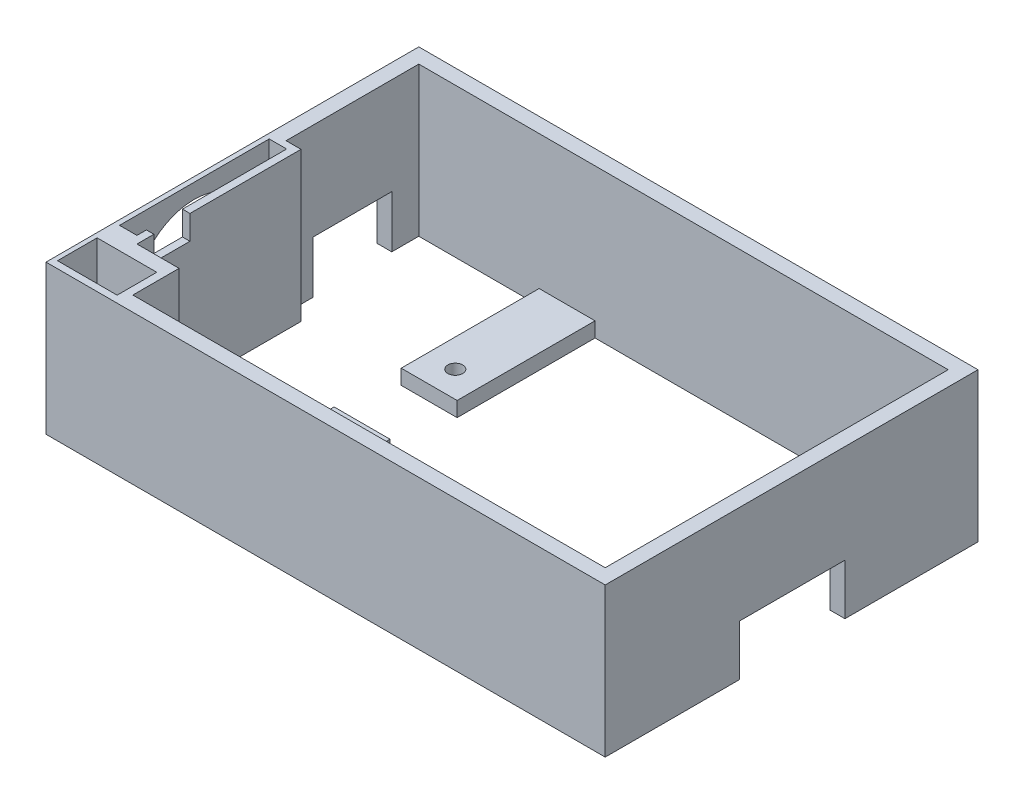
ISO-10303-21;
HEADER;
FILE_DESCRIPTION(('STEP AP214'),'2;1');
FILE_NAME('part.step','',(''),(''),'','','');
FILE_SCHEMA(('AUTOMOTIVE_DESIGN { 1 0 10303 214 1 1 1 1 }'));
ENDSEC;
DATA;
#1=APPLICATION_CONTEXT('core data for automotive mechanical design processes');
#2=APPLICATION_PROTOCOL_DEFINITION('international standard','automotive_design',2000,#1);
#3=PRODUCT_CONTEXT('',#1,'mechanical');
#4=PRODUCT('Part','Part','',(#3));
#5=PRODUCT_RELATED_PRODUCT_CATEGORY('part','',(#4));
#6=PRODUCT_DEFINITION_FORMATION('','',#4);
#7=PRODUCT_DEFINITION_CONTEXT('part definition',#1,'design');
#8=PRODUCT_DEFINITION('design','',#6,#7);
#9=PRODUCT_DEFINITION_SHAPE('','',#8);
#10=(LENGTH_UNIT() NAMED_UNIT(*) SI_UNIT(.MILLI.,.METRE.));
#11=(NAMED_UNIT(*) PLANE_ANGLE_UNIT() SI_UNIT($,.RADIAN.));
#12=(NAMED_UNIT(*) SI_UNIT($,.STERADIAN.) SOLID_ANGLE_UNIT());
#13=UNCERTAINTY_MEASURE_WITH_UNIT(LENGTH_MEASURE(1.E-05),#10,'distance_accuracy_value','');
#14=(GEOMETRIC_REPRESENTATION_CONTEXT(3) GLOBAL_UNCERTAINTY_ASSIGNED_CONTEXT((#13)) GLOBAL_UNIT_ASSIGNED_CONTEXT((#10,
#11,#12)) REPRESENTATION_CONTEXT('',''));
#15=CARTESIAN_POINT('',(0.,0.,0.));
#16=DIRECTION('',(0.,0.,1.));
#17=DIRECTION('',(1.,0.,0.));
#18=AXIS2_PLACEMENT_3D('',#15,#16,#17);
#19=CARTESIAN_POINT('',(0.,0.,0.));
#20=DIRECTION('',(0.,-1.,0.));
#21=DIRECTION('',(0.,0.,-1.));
#22=AXIS2_PLACEMENT_3D('',#19,#20,#21);
#23=PLANE('',#22);
#24=DIRECTION('',(1.,0.,0.));
#25=VECTOR('',#24,1.);
#26=CARTESIAN_POINT('',(114.639211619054,0.,-64.3044717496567));
#27=LINE('',#26,#25);
#28=CARTESIAN_POINT('',(146.,0.,-64.3044717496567));
#29=VERTEX_POINT('',#28);
#30=CARTESIAN_POINT('',(150.,0.,-64.3044717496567));
#31=VERTEX_POINT('',#30);
#32=EDGE_CURVE('E472',#29,#31,#27,.T.);
#33=ORIENTED_EDGE('',*,*,#32,.F.);
#34=DIRECTION('',(0.,0.,-1.));
#35=VECTOR('',#34,1.);
#36=CARTESIAN_POINT('',(146.,0.,-96.));
#37=LINE('',#36,#35);
#38=CARTESIAN_POINT('',(146.,0.,-96.));
#39=VERTEX_POINT('',#38);
#40=EDGE_CURVE('E728',#29,#39,#37,.T.);
#41=ORIENTED_EDGE('',*,*,#40,.T.);
#42=DIRECTION('',(-1.,0.,0.));
#43=VECTOR('',#42,1.);
#44=CARTESIAN_POINT('',(4.00000000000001,0.,-96.));
#45=LINE('',#44,#43);
#46=CARTESIAN_POINT('',(127.539769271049,0.,-96.));
#47=VERTEX_POINT('',#46);
#48=EDGE_CURVE('E714',#39,#47,#45,.T.);
#49=ORIENTED_EDGE('',*,*,#48,.T.);
#50=DIRECTION('',(0.,0.,1.));
#51=VECTOR('',#50,1.);
#52=CARTESIAN_POINT('',(127.539769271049,0.,-96.));
#53=LINE('',#52,#51);
#54=CARTESIAN_POINT('',(127.539769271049,0.,-59.));
#55=VERTEX_POINT('',#54);
#56=EDGE_CURVE('E547',#47,#55,#53,.T.);
#57=ORIENTED_EDGE('',*,*,#56,.T.);
#58=DIRECTION('',(-1.,0.,0.));
#59=VECTOR('',#58,1.);
#60=CARTESIAN_POINT('',(127.539769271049,0.,-59.));
#61=LINE('',#60,#59);
#62=CARTESIAN_POINT('',(112.539769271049,0.,-59.));
#63=VERTEX_POINT('',#62);
#64=EDGE_CURVE('E543',#55,#63,#61,.T.);
#65=ORIENTED_EDGE('',*,*,#64,.T.);
#66=DIRECTION('',(0.,0.,-1.));
#67=VECTOR('',#66,1.);
#68=CARTESIAN_POINT('',(112.539769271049,0.,-96.));
#69=LINE('',#68,#67);
#70=CARTESIAN_POINT('',(112.539769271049,0.,-96.));
#71=VERTEX_POINT('',#70);
#72=EDGE_CURVE('E541',#63,#71,#69,.T.);
#73=ORIENTED_EDGE('',*,*,#72,.T.);
#74=CARTESIAN_POINT('',(51.2789890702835,0.,-96.));
#75=VERTEX_POINT('',#74);
#76=EDGE_CURVE('E736',#71,#75,#45,.T.);
#77=ORIENTED_EDGE('',*,*,#76,.T.);
#78=DIRECTION('',(0.,0.,1.));
#79=VECTOR('',#78,1.);
#80=CARTESIAN_POINT('',(51.2789890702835,0.,-96.));
#81=LINE('',#80,#79);
#82=CARTESIAN_POINT('',(51.2789890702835,0.,-59.));
#83=VERTEX_POINT('',#82);
#84=EDGE_CURVE('E579',#75,#83,#81,.T.);
#85=ORIENTED_EDGE('',*,*,#84,.T.);
#86=DIRECTION('',(-1.,0.,0.));
#87=VECTOR('',#86,1.);
#88=CARTESIAN_POINT('',(36.2789890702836,0.,-59.));
#89=LINE('',#88,#87);
#90=CARTESIAN_POINT('',(36.2789890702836,0.,-59.));
#91=VERTEX_POINT('',#90);
#92=EDGE_CURVE('E576',#83,#91,#89,.T.);
#93=ORIENTED_EDGE('',*,*,#92,.T.);
#94=DIRECTION('',(0.,0.,-1.));
#95=VECTOR('',#94,1.);
#96=CARTESIAN_POINT('',(36.2789890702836,0.,-96.));
#97=LINE('',#96,#95);
#98=CARTESIAN_POINT('',(36.2789890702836,0.,-96.));
#99=VERTEX_POINT('',#98);
#100=EDGE_CURVE('E583',#91,#99,#97,.T.);
#101=ORIENTED_EDGE('',*,*,#100,.T.);
#102=CARTESIAN_POINT('',(4.00000000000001,0.,-96.));
#103=VERTEX_POINT('',#102);
#104=EDGE_CURVE('E733',#99,#103,#45,.T.);
#105=ORIENTED_EDGE('',*,*,#104,.T.);
#106=DIRECTION('',(0.,0.,1.));
#107=VECTOR('',#106,1.);
#108=CARTESIAN_POINT('',(4.00000000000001,0.,-96.));
#109=LINE('',#108,#107);
#110=CARTESIAN_POINT('',(4.00000000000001,0.,-88.75));
#111=VERTEX_POINT('',#110);
#112=EDGE_CURVE('E722',#103,#111,#109,.T.);
#113=ORIENTED_EDGE('',*,*,#112,.T.);
#114=DIRECTION('',(1.,0.,0.));
#115=VECTOR('',#114,1.);
#116=CARTESIAN_POINT('',(-5.99999999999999,0.,-88.75));
#117=LINE('',#116,#115);
#118=CARTESIAN_POINT('',(0.,0.,-88.75));
#119=VERTEX_POINT('',#118);
#120=EDGE_CURVE('E644',#119,#111,#117,.T.);
#121=ORIENTED_EDGE('',*,*,#120,.F.);
#122=DIRECTION('',(0.,0.,1.));
#123=VECTOR('',#122,1.);
#124=CARTESIAN_POINT('',(0.,0.,0.));
#125=LINE('',#124,#123);
#126=CARTESIAN_POINT('',(0.,0.,-100.));
#127=VERTEX_POINT('',#126);
#128=EDGE_CURVE('E757',#127,#119,#125,.T.);
#129=ORIENTED_EDGE('',*,*,#128,.F.);
#130=DIRECTION('',(-1.,0.,0.));
#131=VECTOR('',#130,1.);
#132=CARTESIAN_POINT('',(0.,0.,-100.));
#133=LINE('',#132,#131);
#134=CARTESIAN_POINT('',(150.,0.,-100.));
#135=VERTEX_POINT('',#134);
#136=EDGE_CURVE('E750',#135,#127,#133,.T.);
#137=ORIENTED_EDGE('',*,*,#136,.F.);
#138=DIRECTION('',(0.,0.,-1.));
#139=VECTOR('',#138,1.);
#140=CARTESIAN_POINT('',(150.,0.,0.));
#141=LINE('',#140,#139);
#142=EDGE_CURVE('E762',#31,#135,#141,.T.);
#143=ORIENTED_EDGE('',*,*,#142,.F.);
#144=EDGE_LOOP('',(#33,#41,#49,#57,#65,#73,#77,#85,#93,#101,#105,#113,#121,#129,#137,#143));
#145=FACE_BOUND('',#144,.T.);
#146=CARTESIAN_POINT('',(120.039769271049,0.,-65.2430702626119));
#147=DIRECTION('',(0.,-1.,0.));
#148=DIRECTION('',(0.,0.,-1.));
#149=AXIS2_PLACEMENT_3D('',#146,#147,#148);
#150=CIRCLE('',#149,2.);
#151=CARTESIAN_POINT('',(120.039769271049,0.,-67.2430702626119));
#152=VERTEX_POINT('',#151);
#153=EDGE_CURVE('E560',#152,#152,#150,.T.);
#154=ORIENTED_EDGE('',*,*,#153,.F.);
#155=EDGE_LOOP('',(#154));
#156=FACE_BOUND('',#155,.T.);
#157=CARTESIAN_POINT('',(43.7789890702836,0.,-66.));
#158=DIRECTION('',(0.,-1.,0.));
#159=DIRECTION('',(0.,0.,-1.));
#160=AXIS2_PLACEMENT_3D('',#157,#158,#159);
#161=CIRCLE('',#160,2.);
#162=CARTESIAN_POINT('',(43.7789890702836,0.,-68.));
#163=VERTEX_POINT('',#162);
#164=EDGE_CURVE('E596',#163,#163,#161,.T.);
#165=ORIENTED_EDGE('',*,*,#164,.F.);
#166=EDGE_LOOP('',(#165));
#167=FACE_BOUND('',#166,.T.);
#168=ADVANCED_FACE('F40',(#145,#156,#167),#23,.T.);
#169=CARTESIAN_POINT('',(8.00000000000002,40.,-18.3994200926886));
#170=DIRECTION('',(0.,0.,1.));
#171=DIRECTION('',(1.,0.,0.));
#172=AXIS2_PLACEMENT_3D('',#169,#170,#171);
#173=PLANE('',#172);
#174=DIRECTION('',(0.,1.,0.));
#175=VECTOR('',#174,1.);
#176=CARTESIAN_POINT('',(6.00000000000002,40.,-18.3994200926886));
#177=LINE('',#176,#175);
#178=CARTESIAN_POINT('',(6.00000000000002,0.,-18.3994200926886));
#179=VERTEX_POINT('',#178);
#180=CARTESIAN_POINT('',(6.00000000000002,40.,-18.3994200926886));
#181=VERTEX_POINT('',#180);
#182=EDGE_CURVE('E677',#179,#181,#177,.T.);
#183=ORIENTED_EDGE('',*,*,#182,.F.);
#184=DIRECTION('',(-1.,0.,0.));
#185=VECTOR('',#184,1.);
#186=CARTESIAN_POINT('',(8.00000000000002,0.,-18.3994200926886));
#187=LINE('',#186,#185);
#188=CARTESIAN_POINT('',(1.32000000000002,0.,-18.3994200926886));
#189=VERTEX_POINT('',#188);
#190=EDGE_CURVE('E705',#179,#189,#187,.T.);
#191=ORIENTED_EDGE('',*,*,#190,.T.);
#192=DIRECTION('',(0.,1.,0.));
#193=VECTOR('',#192,1.);
#194=CARTESIAN_POINT('',(1.32000000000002,-40.4218369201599,-18.3994200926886));
#195=LINE('',#194,#193);
#196=CARTESIAN_POINT('',(1.32000000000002,40.,-18.3994200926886));
#197=VERTEX_POINT('',#196);
#198=EDGE_CURVE('E670',#189,#197,#195,.T.);
#199=ORIENTED_EDGE('',*,*,#198,.T.);
#200=DIRECTION('',(-1.,0.,0.));
#201=VECTOR('',#200,1.);
#202=CARTESIAN_POINT('',(8.00000000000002,40.,-18.3994200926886));
#203=LINE('',#202,#201);
#204=EDGE_CURVE('E707',#181,#197,#203,.T.);
#205=ORIENTED_EDGE('',*,*,#204,.F.);
#206=EDGE_LOOP('',(#183,#191,#199,#205));
#207=FACE_BOUND('',#206,.T.);
#208=ADVANCED_FACE('F809',(#207),#173,.F.);
#209=CARTESIAN_POINT('',(4.00000000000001,40.,-96.));
#210=DIRECTION('',(1.,0.,0.));
#211=DIRECTION('',(0.,0.,-1.));
#212=AXIS2_PLACEMENT_3D('',#209,#210,#211);
#213=PLANE('',#212);
#214=DIRECTION('',(0.,-1.,0.));
#215=VECTOR('',#214,1.);
#216=CARTESIAN_POINT('',(4.00000000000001,0.,-67.65));
#217=LINE('',#216,#215);
#218=CARTESIAN_POINT('',(4.00000000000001,14.,-67.65));
#219=VERTEX_POINT('',#218);
#220=CARTESIAN_POINT('',(4.00000000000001,0.,-67.65));
#221=VERTEX_POINT('',#220);
#222=EDGE_CURVE('E642',#219,#221,#217,.T.);
#223=ORIENTED_EDGE('',*,*,#222,.F.);
#224=DIRECTION('',(0.,0.,1.));
#225=VECTOR('',#224,1.);
#226=CARTESIAN_POINT('',(4.00000000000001,14.,-67.65));
#227=LINE('',#226,#225);
#228=CARTESIAN_POINT('',(4.00000000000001,14.,-88.75));
#229=VERTEX_POINT('',#228);
#230=EDGE_CURVE('E639',#229,#219,#227,.T.);
#231=ORIENTED_EDGE('',*,*,#230,.F.);
#232=DIRECTION('',(0.,1.,0.));
#233=VECTOR('',#232,1.);
#234=CARTESIAN_POINT('',(4.00000000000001,0.,-88.75));
#235=LINE('',#234,#233);
#236=EDGE_CURVE('E630',#111,#229,#235,.T.);
#237=ORIENTED_EDGE('',*,*,#236,.F.);
#238=ORIENTED_EDGE('',*,*,#112,.F.);
#239=DIRECTION('',(0.,-1.,0.));
#240=VECTOR('',#239,1.);
#241=CARTESIAN_POINT('',(4.00000000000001,40.,-96.));
#242=LINE('',#241,#240);
#243=CARTESIAN_POINT('',(4.00000000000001,40.,-96.));
#244=VERTEX_POINT('',#243);
#245=EDGE_CURVE('E721',#244,#103,#242,.T.);
#246=ORIENTED_EDGE('',*,*,#245,.F.);
#247=DIRECTION('',(0.,0.,1.));
#248=VECTOR('',#247,1.);
#249=CARTESIAN_POINT('',(4.00000000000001,40.,-96.));
#250=LINE('',#249,#248);
#251=CARTESIAN_POINT('',(4.00000000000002,40.,-60.3994200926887));
#252=VERTEX_POINT('',#251);
#253=EDGE_CURVE('E710',#244,#252,#250,.T.);
#254=ORIENTED_EDGE('',*,*,#253,.T.);
#255=DIRECTION('',(0.,1.,0.));
#256=VECTOR('',#255,1.);
#257=CARTESIAN_POINT('',(4.00000000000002,40.,-60.3994200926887));
#258=LINE('',#257,#256);
#259=CARTESIAN_POINT('',(4.00000000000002,0.,-60.3994200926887));
#260=VERTEX_POINT('',#259);
#261=EDGE_CURVE('E692',#260,#252,#258,.T.);
#262=ORIENTED_EDGE('',*,*,#261,.F.);
#263=EDGE_CURVE('E709',#221,#260,#109,.T.);
#264=ORIENTED_EDGE('',*,*,#263,.F.);
#265=EDGE_LOOP('',(#223,#231,#237,#238,#246,#254,#262,#264));
#266=FACE_BOUND('',#265,.T.);
#267=ADVANCED_FACE('F833',(#266),#213,.T.);
#268=CARTESIAN_POINT('',(0.,40.,0.));
#269=DIRECTION('',(0.,-1.,0.));
#270=DIRECTION('',(0.,0.,-1.));
#271=AXIS2_PLACEMENT_3D('',#268,#269,#270);
#272=PLANE('',#271);
#273=DIRECTION('',(1.,0.,0.));
#274=VECTOR('',#273,1.);
#275=CARTESIAN_POINT('',(1.22000000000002,40.,-1.86260407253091));
#276=LINE('',#275,#274);
#277=CARTESIAN_POINT('',(1.22000000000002,40.,-1.86260407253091));
#278=VERTEX_POINT('',#277);
#279=CARTESIAN_POINT('',(17.22,40.,-1.86260407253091));
#280=VERTEX_POINT('',#279);
#281=EDGE_CURVE('E436',#278,#280,#276,.T.);
#282=ORIENTED_EDGE('',*,*,#281,.F.);
#283=DIRECTION('',(0.,0.,1.));
#284=VECTOR('',#283,1.);
#285=CARTESIAN_POINT('',(1.22000000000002,40.,-1.86260407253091));
#286=LINE('',#285,#284);
#287=CARTESIAN_POINT('',(1.22000000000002,40.,-12.4926040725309));
#288=VERTEX_POINT('',#287);
#289=EDGE_CURVE('E420',#288,#278,#286,.T.);
#290=ORIENTED_EDGE('',*,*,#289,.F.);
#291=DIRECTION('',(-1.,0.,0.));
#292=VECTOR('',#291,1.);
#293=CARTESIAN_POINT('',(1.22000000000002,40.,-12.4926040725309));
#294=LINE('',#293,#292);
#295=CARTESIAN_POINT('',(17.22,40.,-12.4926040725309));
#296=VERTEX_POINT('',#295);
#297=EDGE_CURVE('E425',#296,#288,#294,.T.);
#298=ORIENTED_EDGE('',*,*,#297,.F.);
#299=DIRECTION('',(0.,0.,-1.));
#300=VECTOR('',#299,1.);
#301=CARTESIAN_POINT('',(17.22,40.,-1.86260407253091));
#302=LINE('',#301,#300);
#303=EDGE_CURVE('E439',#280,#296,#302,.T.);
#304=ORIENTED_EDGE('',*,*,#303,.F.);
#305=EDGE_LOOP('',(#282,#290,#298,#304));
#306=FACE_BOUND('',#305,.T.);
#307=DIRECTION('',(0.,0.,1.));
#308=VECTOR('',#307,1.);
#309=CARTESIAN_POINT('',(8.00000000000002,40.,-16.3994200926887));
#310=LINE('',#309,#308);
#311=CARTESIAN_POINT('',(8.00000000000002,40.,-20.9377457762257));
#312=VERTEX_POINT('',#311);
#313=CARTESIAN_POINT('',(8.00000000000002,40.,-16.3994200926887));
#314=VERTEX_POINT('',#313);
#315=EDGE_CURVE('E695',#312,#314,#310,.T.);
#316=ORIENTED_EDGE('',*,*,#315,.F.);
#317=DIRECTION('',(1.,0.,0.));
#318=VECTOR('',#317,1.);
#319=CARTESIAN_POINT('',(4.00000000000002,40.,-20.9377457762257));
#320=LINE('',#319,#318);
#321=CARTESIAN_POINT('',(6.00000000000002,40.,-20.9377457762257));
#322=VERTEX_POINT('',#321);
#323=EDGE_CURVE('E382',#322,#312,#320,.T.);
#324=ORIENTED_EDGE('',*,*,#323,.F.);
#325=DIRECTION('',(0.,0.,1.));
#326=VECTOR('',#325,1.);
#327=CARTESIAN_POINT('',(6.00000000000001,40.,-100.44938888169));
#328=LINE('',#327,#326);
#329=EDGE_CURVE('E680',#322,#181,#328,.T.);
#330=ORIENTED_EDGE('',*,*,#329,.T.);
#331=ORIENTED_EDGE('',*,*,#204,.T.);
#332=DIRECTION('',(0.,0.,1.));
#333=VECTOR('',#332,1.);
#334=CARTESIAN_POINT('',(1.32000000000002,40.,-18.3994200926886));
#335=LINE('',#334,#333);
#336=CARTESIAN_POINT('',(1.32000000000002,40.,-58.5494200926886));
#337=VERTEX_POINT('',#336);
#338=EDGE_CURVE('E658',#337,#197,#335,.T.);
#339=ORIENTED_EDGE('',*,*,#338,.F.);
#340=DIRECTION('',(-1.,0.,0.));
#341=VECTOR('',#340,1.);
#342=CARTESIAN_POINT('',(6.00000000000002,40.,-58.5494200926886));
#343=LINE('',#342,#341);
#344=CARTESIAN_POINT('',(6.00000000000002,40.,-58.5494200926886));
#345=VERTEX_POINT('',#344);
#346=EDGE_CURVE('E657',#345,#337,#343,.T.);
#347=ORIENTED_EDGE('',*,*,#346,.F.);
#348=CARTESIAN_POINT('',(6.00000000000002,40.,-30.6083745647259));
#349=VERTEX_POINT('',#348);
#350=EDGE_CURVE('E681',#345,#349,#328,.T.);
#351=ORIENTED_EDGE('',*,*,#350,.T.);
#352=DIRECTION('',(1.,0.,0.));
#353=VECTOR('',#352,1.);
#354=CARTESIAN_POINT('',(4.00000000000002,40.,-30.6083745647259));
#355=LINE('',#354,#353);
#356=CARTESIAN_POINT('',(8.00000000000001,40.,-30.6083745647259));
#357=VERTEX_POINT('',#356);
#358=EDGE_CURVE('E393',#349,#357,#355,.T.);
#359=ORIENTED_EDGE('',*,*,#358,.T.);
#360=CARTESIAN_POINT('',(8.00000000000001,40.,-60.3994200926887));
#361=VERTEX_POINT('',#360);
#362=EDGE_CURVE('E698',#361,#357,#310,.T.);
#363=ORIENTED_EDGE('',*,*,#362,.F.);
#364=DIRECTION('',(-1.,0.,0.));
#365=VECTOR('',#364,1.);
#366=CARTESIAN_POINT('',(8.00000000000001,40.,-60.3994200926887));
#367=LINE('',#366,#365);
#368=EDGE_CURVE('E689',#361,#252,#367,.T.);
#369=ORIENTED_EDGE('',*,*,#368,.T.);
#370=ORIENTED_EDGE('',*,*,#253,.F.);
#371=DIRECTION('',(-1.,0.,0.));
#372=VECTOR('',#371,1.);
#373=CARTESIAN_POINT('',(4.00000000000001,40.,-96.));
#374=LINE('',#373,#372);
#375=CARTESIAN_POINT('',(146.,40.,-96.));
#376=VERTEX_POINT('',#375);
#377=EDGE_CURVE('E719',#376,#244,#374,.T.);
#378=ORIENTED_EDGE('',*,*,#377,.F.);
#379=DIRECTION('',(0.,0.,-1.));
#380=VECTOR('',#379,1.);
#381=CARTESIAN_POINT('',(146.,40.,-96.));
#382=LINE('',#381,#380);
#383=CARTESIAN_POINT('',(146.,40.,-4.));
#384=VERTEX_POINT('',#383);
#385=EDGE_CURVE('E716',#384,#376,#382,.T.);
#386=ORIENTED_EDGE('',*,*,#385,.F.);
#387=DIRECTION('',(1.,0.,0.));
#388=VECTOR('',#387,1.);
#389=CARTESIAN_POINT('',(4.00000000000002,40.,-4.));
#390=LINE('',#389,#388);
#391=CARTESIAN_POINT('',(19.3,40.,-4.));
#392=VERTEX_POINT('',#391);
#393=EDGE_CURVE('E713',#392,#384,#390,.T.);
#394=ORIENTED_EDGE('',*,*,#393,.F.);
#395=DIRECTION('',(0.,0.,-1.));
#396=VECTOR('',#395,1.);
#397=CARTESIAN_POINT('',(19.3,40.,-16.3994200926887));
#398=LINE('',#397,#396);
#399=CARTESIAN_POINT('',(19.3,40.,-16.3994200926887));
#400=VERTEX_POINT('',#399);
#401=EDGE_CURVE('E446',#392,#400,#398,.T.);
#402=ORIENTED_EDGE('',*,*,#401,.T.);
#403=DIRECTION('',(-1.,0.,0.));
#404=VECTOR('',#403,1.);
#405=CARTESIAN_POINT('',(4.00000000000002,40.,-16.3994200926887));
#406=LINE('',#405,#404);
#407=EDGE_CURVE('E453',#400,#314,#406,.T.);
#408=ORIENTED_EDGE('',*,*,#407,.T.);
#409=EDGE_LOOP('',(#316,#324,#330,#331,#339,#347,#351,#359,#363,#369,#370,#378,#386,#394,#402,#408));
#410=FACE_BOUND('',#409,.T.);
#411=DIRECTION('',(0.,0.,1.));
#412=VECTOR('',#411,1.);
#413=CARTESIAN_POINT('',(0.,40.,0.));
#414=LINE('',#413,#412);
#415=CARTESIAN_POINT('',(0.,40.,-100.));
#416=VERTEX_POINT('',#415);
#417=CARTESIAN_POINT('',(0.,40.,0.));
#418=VERTEX_POINT('',#417);
#419=EDGE_CURVE('E746',#416,#418,#414,.T.);
#420=ORIENTED_EDGE('',*,*,#419,.T.);
#421=DIRECTION('',(1.,0.,0.));
#422=VECTOR('',#421,1.);
#423=CARTESIAN_POINT('',(0.,40.,0.));
#424=LINE('',#423,#422);
#425=CARTESIAN_POINT('',(150.,40.,0.));
#426=VERTEX_POINT('',#425);
#427=EDGE_CURVE('E749',#418,#426,#424,.T.);
#428=ORIENTED_EDGE('',*,*,#427,.T.);
#429=DIRECTION('',(0.,0.,-1.));
#430=VECTOR('',#429,1.);
#431=CARTESIAN_POINT('',(150.,40.,0.));
#432=LINE('',#431,#430);
#433=CARTESIAN_POINT('',(150.,40.,-100.));
#434=VERTEX_POINT('',#433);
#435=EDGE_CURVE('E752',#426,#434,#432,.T.);
#436=ORIENTED_EDGE('',*,*,#435,.T.);
#437=DIRECTION('',(-1.,0.,0.));
#438=VECTOR('',#437,1.);
#439=CARTESIAN_POINT('',(0.,40.,-100.));
#440=LINE('',#439,#438);
#441=EDGE_CURVE('E754',#434,#416,#440,.T.);
#442=ORIENTED_EDGE('',*,*,#441,.T.);
#443=EDGE_LOOP('',(#420,#428,#436,#442));
#444=FACE_BOUND('',#443,.T.);
#445=ADVANCED_FACE('F797',(#306,#410,#444),#272,.F.);
#446=DIRECTION('',(0.,0.,-1.));
#447=VECTOR('',#446,1.);
#448=CARTESIAN_POINT('',(19.3,0.,-16.3994200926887));
#449=LINE('',#448,#447);
#450=CARTESIAN_POINT('',(19.3,0.,-4.));
#451=VERTEX_POINT('',#450);
#452=CARTESIAN_POINT('',(19.3,0.,-16.3994200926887));
#453=VERTEX_POINT('',#452);
#454=EDGE_CURVE('E463',#451,#453,#449,.T.);
#455=ORIENTED_EDGE('',*,*,#454,.F.);
#456=DIRECTION('',(1.,0.,0.));
#457=VECTOR('',#456,1.);
#458=CARTESIAN_POINT('',(4.00000000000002,0.,-4.));
#459=LINE('',#458,#457);
#460=CARTESIAN_POINT('',(36.2789890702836,0.,-4.));
#461=VERTEX_POINT('',#460);
#462=EDGE_CURVE('E726',#451,#461,#459,.T.);
#463=ORIENTED_EDGE('',*,*,#462,.T.);
#464=DIRECTION('',(0.,0.,-1.));
#465=VECTOR('',#464,1.);
#466=CARTESIAN_POINT('',(36.2789890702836,0.,-4.));
#467=LINE('',#466,#465);
#468=CARTESIAN_POINT('',(36.2789890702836,0.,-41.));
#469=VERTEX_POINT('',#468);
#470=EDGE_CURVE('E605',#461,#469,#467,.T.);
#471=ORIENTED_EDGE('',*,*,#470,.T.);
#472=DIRECTION('',(1.,0.,0.));
#473=VECTOR('',#472,1.);
#474=CARTESIAN_POINT('',(36.2789890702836,0.,-41.));
#475=LINE('',#474,#473);
#476=CARTESIAN_POINT('',(51.2789890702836,0.,-41.));
#477=VERTEX_POINT('',#476);
#478=EDGE_CURVE('E623',#469,#477,#475,.T.);
#479=ORIENTED_EDGE('',*,*,#478,.T.);
#480=DIRECTION('',(0.,0.,1.));
#481=VECTOR('',#480,1.);
#482=CARTESIAN_POINT('',(51.2789890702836,0.,-4.));
#483=LINE('',#482,#481);
#484=CARTESIAN_POINT('',(51.2789890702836,0.,-4.));
#485=VERTEX_POINT('',#484);
#486=EDGE_CURVE('E612',#477,#485,#483,.T.);
#487=ORIENTED_EDGE('',*,*,#486,.T.);
#488=CARTESIAN_POINT('',(112.539769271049,0.,-4.));
#489=VERTEX_POINT('',#488);
#490=EDGE_CURVE('E729',#485,#489,#459,.T.);
#491=ORIENTED_EDGE('',*,*,#490,.T.);
#492=DIRECTION('',(0.,0.,-1.));
#493=VECTOR('',#492,1.);
#494=CARTESIAN_POINT('',(112.539769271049,0.,-4.));
#495=LINE('',#494,#493);
#496=CARTESIAN_POINT('',(112.539769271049,0.,-41.));
#497=VERTEX_POINT('',#496);
#498=EDGE_CURVE('E508',#489,#497,#495,.T.);
#499=ORIENTED_EDGE('',*,*,#498,.T.);
#500=DIRECTION('',(1.,0.,0.));
#501=VECTOR('',#500,1.);
#502=CARTESIAN_POINT('',(127.539769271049,0.,-41.));
#503=LINE('',#502,#501);
#504=CARTESIAN_POINT('',(127.539769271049,0.,-41.));
#505=VERTEX_POINT('',#504);
#506=EDGE_CURVE('E505',#497,#505,#503,.T.);
#507=ORIENTED_EDGE('',*,*,#506,.T.);
#508=DIRECTION('',(0.,0.,1.));
#509=VECTOR('',#508,1.);
#510=CARTESIAN_POINT('',(127.539769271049,0.,-4.));
#511=LINE('',#510,#509);
#512=CARTESIAN_POINT('',(127.539769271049,0.,-4.));
#513=VERTEX_POINT('',#512);
#514=EDGE_CURVE('E512',#505,#513,#511,.T.);
#515=ORIENTED_EDGE('',*,*,#514,.T.);
#516=CARTESIAN_POINT('',(146.,0.,-4.));
#517=VERTEX_POINT('',#516);
#518=EDGE_CURVE('E725',#513,#517,#459,.T.);
#519=ORIENTED_EDGE('',*,*,#518,.T.);
#520=CARTESIAN_POINT('',(146.,0.,-36.0481032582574));
#521=VERTEX_POINT('',#520);
#522=EDGE_CURVE('E730',#517,#521,#37,.T.);
#523=ORIENTED_EDGE('',*,*,#522,.T.);
#524=DIRECTION('',(1.,0.,0.));
#525=VECTOR('',#524,1.);
#526=CARTESIAN_POINT('',(114.639211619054,0.,-36.0481032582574));
#527=LINE('',#526,#525);
#528=CARTESIAN_POINT('',(150.,0.,-36.0481032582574));
#529=VERTEX_POINT('',#528);
#530=EDGE_CURVE('E480',#521,#529,#527,.T.);
#531=ORIENTED_EDGE('',*,*,#530,.T.);
#532=CARTESIAN_POINT('',(150.,0.,0.));
#533=VERTEX_POINT('',#532);
#534=EDGE_CURVE('E763',#533,#529,#141,.T.);
#535=ORIENTED_EDGE('',*,*,#534,.F.);
#536=DIRECTION('',(1.,0.,0.));
#537=VECTOR('',#536,1.);
#538=CARTESIAN_POINT('',(0.,0.,0.));
#539=LINE('',#538,#537);
#540=CARTESIAN_POINT('',(0.,0.,0.));
#541=VERTEX_POINT('',#540);
#542=EDGE_CURVE('E760',#541,#533,#539,.T.);
#543=ORIENTED_EDGE('',*,*,#542,.F.);
#544=CARTESIAN_POINT('',(0.,0.,-67.65));
#545=VERTEX_POINT('',#544);
#546=EDGE_CURVE('E745',#545,#541,#125,.T.);
#547=ORIENTED_EDGE('',*,*,#546,.F.);
#548=DIRECTION('',(1.,0.,0.));
#549=VECTOR('',#548,1.);
#550=CARTESIAN_POINT('',(-5.99999999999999,0.,-67.65));
#551=LINE('',#550,#549);
#552=EDGE_CURVE('E645',#545,#221,#551,.T.);
#553=ORIENTED_EDGE('',*,*,#552,.T.);
#554=ORIENTED_EDGE('',*,*,#263,.T.);
#555=DIRECTION('',(-1.,0.,0.));
#556=VECTOR('',#555,1.);
#557=CARTESIAN_POINT('',(8.00000000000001,0.,-60.3994200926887));
#558=LINE('',#557,#556);
#559=CARTESIAN_POINT('',(8.00000000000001,0.,-60.3994200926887));
#560=VERTEX_POINT('',#559);
#561=EDGE_CURVE('E686',#560,#260,#558,.T.);
#562=ORIENTED_EDGE('',*,*,#561,.F.);
#563=DIRECTION('',(0.,0.,-1.));
#564=VECTOR('',#563,1.);
#565=CARTESIAN_POINT('',(8.00000000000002,0.,-18.3994200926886));
#566=LINE('',#565,#564);
#567=CARTESIAN_POINT('',(8.00000000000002,0.,-16.3994200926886));
#568=VERTEX_POINT('',#567);
#569=EDGE_CURVE('E703',#568,#560,#566,.T.);
#570=ORIENTED_EDGE('',*,*,#569,.F.);
#571=DIRECTION('',(-1.,0.,0.));
#572=VECTOR('',#571,1.);
#573=CARTESIAN_POINT('',(4.00000000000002,0.,-16.3994200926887));
#574=LINE('',#573,#572);
#575=EDGE_CURVE('E459',#453,#568,#574,.T.);
#576=ORIENTED_EDGE('',*,*,#575,.F.);
#577=EDGE_LOOP('',(#455,#463,#471,#479,#487,#491,#499,#507,#515,#519,#523,#531,#535,#543,#547,
#553,#554,#562,#570,#576));
#578=FACE_BOUND('',#577,.T.);
#579=DIRECTION('',(0.,0.,1.));
#580=VECTOR('',#579,1.);
#581=CARTESIAN_POINT('',(1.32000000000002,0.,-18.3994200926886));
#582=LINE('',#581,#580);
#583=CARTESIAN_POINT('',(1.32000000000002,0.,-58.5494200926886));
#584=VERTEX_POINT('',#583);
#585=EDGE_CURVE('E667',#584,#189,#582,.T.);
#586=ORIENTED_EDGE('',*,*,#585,.T.);
#587=ORIENTED_EDGE('',*,*,#190,.F.);
#588=DIRECTION('',(0.,0.,1.));
#589=VECTOR('',#588,1.);
#590=CARTESIAN_POINT('',(6.00000000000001,0.,-100.44938888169));
#591=LINE('',#590,#589);
#592=CARTESIAN_POINT('',(6.00000000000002,0.,-58.5494200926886));
#593=VERTEX_POINT('',#592);
#594=EDGE_CURVE('E684',#593,#179,#591,.T.);
#595=ORIENTED_EDGE('',*,*,#594,.F.);
#596=DIRECTION('',(-1.,0.,0.));
#597=VECTOR('',#596,1.);
#598=CARTESIAN_POINT('',(6.00000000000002,0.,-58.5494200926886));
#599=LINE('',#598,#597);
#600=EDGE_CURVE('E661',#593,#584,#599,.T.);
#601=ORIENTED_EDGE('',*,*,#600,.T.);
#602=EDGE_LOOP('',(#586,#587,#595,#601));
#603=FACE_BOUND('',#602,.T.);
#604=CARTESIAN_POINT('',(43.7789890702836,0.,-34.));
#605=DIRECTION('',(0.,-1.,0.));
#606=DIRECTION('',(0.,0.,-1.));
#607=AXIS2_PLACEMENT_3D('',#604,#605,#606);
#608=CIRCLE('',#607,2.);
#609=CARTESIAN_POINT('',(43.7789890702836,0.,-36.));
#610=VERTEX_POINT('',#609);
#611=EDGE_CURVE('E599',#610,#610,#608,.T.);
#612=ORIENTED_EDGE('',*,*,#611,.F.);
#613=EDGE_LOOP('',(#612));
#614=FACE_BOUND('',#613,.T.);
#615=CARTESIAN_POINT('',(120.039769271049,0.,-34.));
#616=DIRECTION('',(0.,-1.,0.));
#617=DIRECTION('',(0.,0.,-1.));
#618=AXIS2_PLACEMENT_3D('',#615,#616,#617);
#619=CIRCLE('',#618,2.);
#620=CARTESIAN_POINT('',(120.039769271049,0.,-36.));
#621=VERTEX_POINT('',#620);
#622=EDGE_CURVE('E525',#621,#621,#619,.T.);
#623=ORIENTED_EDGE('',*,*,#622,.F.);
#624=EDGE_LOOP('',(#623));
#625=FACE_BOUND('',#624,.T.);
#626=ADVANCED_FACE('F811',(#578,#603,#614,#625),#23,.T.);
#627=CARTESIAN_POINT('',(0.,40.,0.));
#628=DIRECTION('',(1.,0.,0.));
#629=DIRECTION('',(0.,0.,-1.));
#630=AXIS2_PLACEMENT_3D('',#627,#628,#629);
#631=PLANE('',#630);
#632=CARTESIAN_POINT('',(0.,20.,-38.3994200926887));
#633=DIRECTION('',(1.,0.,0.));
#634=DIRECTION('',(0.,0.,-1.));
#635=AXIS2_PLACEMENT_3D('',#632,#633,#634);
#636=CIRCLE('',#635,16.);
#637=CARTESIAN_POINT('',(0.,20.,-54.3994200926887));
#638=VERTEX_POINT('',#637);
#639=EDGE_CURVE('E654',#638,#638,#636,.T.);
#640=ORIENTED_EDGE('',*,*,#639,.T.);
#641=EDGE_LOOP('',(#640));
#642=FACE_BOUND('',#641,.T.);
#643=DIRECTION('',(0.,0.,1.));
#644=VECTOR('',#643,1.);
#645=CARTESIAN_POINT('',(0.,14.,0.));
#646=LINE('',#645,#644);
#647=CARTESIAN_POINT('',(0.,14.,-88.75));
#648=VERTEX_POINT('',#647);
#649=CARTESIAN_POINT('',(0.,14.,-67.65));
#650=VERTEX_POINT('',#649);
#651=EDGE_CURVE('E783',#648,#650,#646,.T.);
#652=ORIENTED_EDGE('',*,*,#651,.T.);
#653=DIRECTION('',(0.,-1.,0.));
#654=VECTOR('',#653,1.);
#655=CARTESIAN_POINT('',(0.,40.,-67.65));
#656=LINE('',#655,#654);
#657=EDGE_CURVE('E786',#650,#545,#656,.T.);
#658=ORIENTED_EDGE('',*,*,#657,.T.);
#659=ORIENTED_EDGE('',*,*,#546,.T.);
#660=DIRECTION('',(0.,-1.,0.));
#661=VECTOR('',#660,1.);
#662=CARTESIAN_POINT('',(0.,40.,0.));
#663=LINE('',#662,#661);
#664=EDGE_CURVE('E775',#418,#541,#663,.T.);
#665=ORIENTED_EDGE('',*,*,#664,.F.);
#666=ORIENTED_EDGE('',*,*,#419,.F.);
#667=DIRECTION('',(0.,-1.,0.));
#668=VECTOR('',#667,1.);
#669=CARTESIAN_POINT('',(0.,40.,-100.));
#670=LINE('',#669,#668);
#671=EDGE_CURVE('E756',#416,#127,#670,.T.);
#672=ORIENTED_EDGE('',*,*,#671,.T.);
#673=ORIENTED_EDGE('',*,*,#128,.T.);
#674=DIRECTION('',(0.,1.,0.));
#675=VECTOR('',#674,1.);
#676=CARTESIAN_POINT('',(0.,40.,-88.75));
#677=LINE('',#676,#675);
#678=EDGE_CURVE('E778',#119,#648,#677,.T.);
#679=ORIENTED_EDGE('',*,*,#678,.T.);
#680=EDGE_LOOP('',(#652,#658,#659,#665,#666,#672,#673,#679));
#681=FACE_BOUND('',#680,.T.);
#682=ADVANCED_FACE('F42',(#642,#681),#631,.F.);
#683=CARTESIAN_POINT('',(0.,40.,0.));
#684=DIRECTION('',(0.,0.,-1.));
#685=DIRECTION('',(-1.,0.,0.));
#686=AXIS2_PLACEMENT_3D('',#683,#684,#685);
#687=PLANE('',#686);
#688=ORIENTED_EDGE('',*,*,#542,.T.);
#689=DIRECTION('',(0.,-1.,0.));
#690=VECTOR('',#689,1.);
#691=CARTESIAN_POINT('',(150.,40.,0.));
#692=LINE('',#691,#690);
#693=EDGE_CURVE('E772',#426,#533,#692,.T.);
#694=ORIENTED_EDGE('',*,*,#693,.F.);
#695=ORIENTED_EDGE('',*,*,#427,.F.);
#696=ORIENTED_EDGE('',*,*,#664,.T.);
#697=EDGE_LOOP('',(#688,#694,#695,#696));
#698=FACE_BOUND('',#697,.T.);
#699=ADVANCED_FACE('F845',(#698),#687,.F.);
#700=CARTESIAN_POINT('',(150.,40.,0.));
#701=DIRECTION('',(-1.,0.,0.));
#702=DIRECTION('',(0.,0.,1.));
#703=AXIS2_PLACEMENT_3D('',#700,#701,#702);
#704=PLANE('',#703);
#705=DIRECTION('',(0.,0.,1.));
#706=VECTOR('',#705,1.);
#707=CARTESIAN_POINT('',(150.,13.6042893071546,-36.0481032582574));
#708=LINE('',#707,#706);
#709=CARTESIAN_POINT('',(150.,13.6042893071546,-64.3044717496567));
#710=VERTEX_POINT('',#709);
#711=CARTESIAN_POINT('',(150.,13.6042893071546,-36.0481032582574));
#712=VERTEX_POINT('',#711);
#713=EDGE_CURVE('E469',#710,#712,#708,.T.);
#714=ORIENTED_EDGE('',*,*,#713,.F.);
#715=DIRECTION('',(0.,1.,0.));
#716=VECTOR('',#715,1.);
#717=CARTESIAN_POINT('',(150.,0.,-64.3044717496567));
#718=LINE('',#717,#716);
#719=EDGE_CURVE('E473',#31,#710,#718,.T.);
#720=ORIENTED_EDGE('',*,*,#719,.F.);
#721=ORIENTED_EDGE('',*,*,#142,.T.);
#722=DIRECTION('',(0.,-1.,0.));
#723=VECTOR('',#722,1.);
#724=CARTESIAN_POINT('',(150.,40.,-100.));
#725=LINE('',#724,#723);
#726=EDGE_CURVE('E769',#434,#135,#725,.T.);
#727=ORIENTED_EDGE('',*,*,#726,.F.);
#728=ORIENTED_EDGE('',*,*,#435,.F.);
#729=ORIENTED_EDGE('',*,*,#693,.T.);
#730=ORIENTED_EDGE('',*,*,#534,.T.);
#731=DIRECTION('',(0.,-1.,0.));
#732=VECTOR('',#731,1.);
#733=CARTESIAN_POINT('',(150.,0.,-36.0481032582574));
#734=LINE('',#733,#732);
#735=EDGE_CURVE('E461',#712,#529,#734,.T.);
#736=ORIENTED_EDGE('',*,*,#735,.F.);
#737=EDGE_LOOP('',(#714,#720,#721,#727,#728,#729,#730,#736));
#738=FACE_BOUND('',#737,.T.);
#739=ADVANCED_FACE('F893',(#738),#704,.F.);
#740=CARTESIAN_POINT('',(0.,40.,-100.));
#741=DIRECTION('',(0.,0.,1.));
#742=DIRECTION('',(1.,0.,0.));
#743=AXIS2_PLACEMENT_3D('',#740,#741,#742);
#744=PLANE('',#743);
#745=ORIENTED_EDGE('',*,*,#136,.T.);
#746=ORIENTED_EDGE('',*,*,#671,.F.);
#747=ORIENTED_EDGE('',*,*,#441,.F.);
#748=ORIENTED_EDGE('',*,*,#726,.T.);
#749=EDGE_LOOP('',(#745,#746,#747,#748));
#750=FACE_BOUND('',#749,.T.);
#751=ADVANCED_FACE('F938',(#750),#744,.F.);
#752=CARTESIAN_POINT('',(4.00000000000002,40.,-4.));
#753=DIRECTION('',(0.,0.,-1.));
#754=DIRECTION('',(-1.,0.,0.));
#755=AXIS2_PLACEMENT_3D('',#752,#753,#754);
#756=PLANE('',#755);
#757=DIRECTION('',(0.,1.,0.));
#758=VECTOR('',#757,1.);
#759=CARTESIAN_POINT('',(19.3,-19.6935425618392,-4.));
#760=LINE('',#759,#758);
#761=EDGE_CURVE('E456',#451,#392,#760,.T.);
#762=ORIENTED_EDGE('',*,*,#761,.T.);
#763=ORIENTED_EDGE('',*,*,#393,.T.);
#764=DIRECTION('',(0.,-1.,0.));
#765=VECTOR('',#764,1.);
#766=CARTESIAN_POINT('',(146.,40.,-4.));
#767=LINE('',#766,#765);
#768=EDGE_CURVE('E742',#384,#517,#767,.T.);
#769=ORIENTED_EDGE('',*,*,#768,.T.);
#770=ORIENTED_EDGE('',*,*,#518,.F.);
#771=DIRECTION('',(0.,-1.,0.));
#772=VECTOR('',#771,1.);
#773=CARTESIAN_POINT('',(127.539769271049,4.,-4.));
#774=LINE('',#773,#772);
#775=CARTESIAN_POINT('',(127.539769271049,4.,-4.));
#776=VERTEX_POINT('',#775);
#777=EDGE_CURVE('E495',#776,#513,#774,.T.);
#778=ORIENTED_EDGE('',*,*,#777,.F.);
#779=DIRECTION('',(-1.,0.,0.));
#780=VECTOR('',#779,1.);
#781=CARTESIAN_POINT('',(127.539769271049,4.,-4.));
#782=LINE('',#781,#780);
#783=CARTESIAN_POINT('',(112.539769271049,4.,-4.));
#784=VERTEX_POINT('',#783);
#785=EDGE_CURVE('E520',#776,#784,#782,.T.);
#786=ORIENTED_EDGE('',*,*,#785,.T.);
#787=DIRECTION('',(0.,-1.,0.));
#788=VECTOR('',#787,1.);
#789=CARTESIAN_POINT('',(112.539769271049,4.,-4.));
#790=LINE('',#789,#788);
#791=EDGE_CURVE('E499',#784,#489,#790,.T.);
#792=ORIENTED_EDGE('',*,*,#791,.T.);
#793=ORIENTED_EDGE('',*,*,#490,.F.);
#794=DIRECTION('',(0.,-1.,0.));
#795=VECTOR('',#794,1.);
#796=CARTESIAN_POINT('',(51.2789890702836,4.,-4.));
#797=LINE('',#796,#795);
#798=CARTESIAN_POINT('',(51.2789890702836,4.,-4.));
#799=VERTEX_POINT('',#798);
#800=EDGE_CURVE('E631',#799,#485,#797,.T.);
#801=ORIENTED_EDGE('',*,*,#800,.F.);
#802=DIRECTION('',(-1.,0.,0.));
#803=VECTOR('',#802,1.);
#804=CARTESIAN_POINT('',(36.2789890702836,4.,-4.));
#805=LINE('',#804,#803);
#806=CARTESIAN_POINT('',(36.2789890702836,4.,-4.));
#807=VERTEX_POINT('',#806);
#808=EDGE_CURVE('E617',#799,#807,#805,.T.);
#809=ORIENTED_EDGE('',*,*,#808,.T.);
#810=DIRECTION('',(0.,-1.,0.));
#811=VECTOR('',#810,1.);
#812=CARTESIAN_POINT('',(36.2789890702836,4.,-4.));
#813=LINE('',#812,#811);
#814=EDGE_CURVE('E627',#807,#461,#813,.T.);
#815=ORIENTED_EDGE('',*,*,#814,.T.);
#816=ORIENTED_EDGE('',*,*,#462,.F.);
#817=EDGE_LOOP('',(#762,#763,#769,#770,#778,#786,#792,#793,#801,#809,#815,#816));
#818=FACE_BOUND('',#817,.T.);
#819=ADVANCED_FACE('F857',(#818),#756,.T.);
#820=CARTESIAN_POINT('',(146.,40.,-96.));
#821=DIRECTION('',(-1.,0.,0.));
#822=DIRECTION('',(0.,0.,1.));
#823=AXIS2_PLACEMENT_3D('',#820,#821,#822);
#824=PLANE('',#823);
#825=DIRECTION('',(0.,1.,0.));
#826=VECTOR('',#825,1.);
#827=CARTESIAN_POINT('',(146.,0.,-64.3044717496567));
#828=LINE('',#827,#826);
#829=CARTESIAN_POINT('',(146.,13.6042893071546,-64.3044717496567));
#830=VERTEX_POINT('',#829);
#831=EDGE_CURVE('E486',#29,#830,#828,.T.);
#832=ORIENTED_EDGE('',*,*,#831,.T.);
#833=DIRECTION('',(0.,0.,1.));
#834=VECTOR('',#833,1.);
#835=CARTESIAN_POINT('',(146.,13.6042893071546,-36.0481032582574));
#836=LINE('',#835,#834);
#837=CARTESIAN_POINT('',(146.,13.6042893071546,-36.0481032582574));
#838=VERTEX_POINT('',#837);
#839=EDGE_CURVE('E482',#830,#838,#836,.T.);
#840=ORIENTED_EDGE('',*,*,#839,.T.);
#841=DIRECTION('',(0.,-1.,0.));
#842=VECTOR('',#841,1.);
#843=CARTESIAN_POINT('',(146.,0.,-36.0481032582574));
#844=LINE('',#843,#842);
#845=EDGE_CURVE('E477',#838,#521,#844,.T.);
#846=ORIENTED_EDGE('',*,*,#845,.T.);
#847=ORIENTED_EDGE('',*,*,#522,.F.);
#848=ORIENTED_EDGE('',*,*,#768,.F.);
#849=ORIENTED_EDGE('',*,*,#385,.T.);
#850=DIRECTION('',(0.,-1.,0.));
#851=VECTOR('',#850,1.);
#852=CARTESIAN_POINT('',(146.,40.,-96.));
#853=LINE('',#852,#851);
#854=EDGE_CURVE('E739',#376,#39,#853,.T.);
#855=ORIENTED_EDGE('',*,*,#854,.T.);
#856=ORIENTED_EDGE('',*,*,#40,.F.);
#857=EDGE_LOOP('',(#832,#840,#846,#847,#848,#849,#855,#856));
#858=FACE_BOUND('',#857,.T.);
#859=ADVANCED_FACE('F882',(#858),#824,.T.);
#860=CARTESIAN_POINT('',(4.00000000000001,40.,-96.));
#861=DIRECTION('',(0.,0.,1.));
#862=DIRECTION('',(1.,0.,0.));
#863=AXIS2_PLACEMENT_3D('',#860,#861,#862);
#864=PLANE('',#863);
#865=DIRECTION('',(0.,-1.,0.));
#866=VECTOR('',#865,1.);
#867=CARTESIAN_POINT('',(127.539769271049,4.,-96.));
#868=LINE('',#867,#866);
#869=CARTESIAN_POINT('',(127.539769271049,4.,-96.));
#870=VERTEX_POINT('',#869);
#871=EDGE_CURVE('E528',#870,#47,#868,.T.);
#872=ORIENTED_EDGE('',*,*,#871,.T.);
#873=ORIENTED_EDGE('',*,*,#48,.F.);
#874=ORIENTED_EDGE('',*,*,#854,.F.);
#875=ORIENTED_EDGE('',*,*,#377,.T.);
#876=ORIENTED_EDGE('',*,*,#245,.T.);
#877=ORIENTED_EDGE('',*,*,#104,.F.);
#878=DIRECTION('',(0.,-1.,0.));
#879=VECTOR('',#878,1.);
#880=CARTESIAN_POINT('',(36.2789890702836,4.,-96.));
#881=LINE('',#880,#879);
#882=CARTESIAN_POINT('',(36.2789890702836,4.,-96.));
#883=VERTEX_POINT('',#882);
#884=EDGE_CURVE('E566',#883,#99,#881,.T.);
#885=ORIENTED_EDGE('',*,*,#884,.F.);
#886=DIRECTION('',(1.,0.,0.));
#887=VECTOR('',#886,1.);
#888=CARTESIAN_POINT('',(36.2789890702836,4.,-96.));
#889=LINE('',#888,#887);
#890=CARTESIAN_POINT('',(51.2789890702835,4.,-96.));
#891=VERTEX_POINT('',#890);
#892=EDGE_CURVE('E591',#883,#891,#889,.T.);
#893=ORIENTED_EDGE('',*,*,#892,.T.);
#894=DIRECTION('',(0.,-1.,0.));
#895=VECTOR('',#894,1.);
#896=CARTESIAN_POINT('',(51.2789890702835,4.,-96.));
#897=LINE('',#896,#895);
#898=EDGE_CURVE('E570',#891,#75,#897,.T.);
#899=ORIENTED_EDGE('',*,*,#898,.T.);
#900=ORIENTED_EDGE('',*,*,#76,.F.);
#901=DIRECTION('',(0.,-1.,0.));
#902=VECTOR('',#901,1.);
#903=CARTESIAN_POINT('',(112.539769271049,4.,-96.));
#904=LINE('',#903,#902);
#905=CARTESIAN_POINT('',(112.539769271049,4.,-96.));
#906=VERTEX_POINT('',#905);
#907=EDGE_CURVE('E536',#906,#71,#904,.T.);
#908=ORIENTED_EDGE('',*,*,#907,.F.);
#909=DIRECTION('',(1.,0.,0.));
#910=VECTOR('',#909,1.);
#911=CARTESIAN_POINT('',(127.539769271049,4.,-96.));
#912=LINE('',#911,#910);
#913=EDGE_CURVE('E533',#906,#870,#912,.T.);
#914=ORIENTED_EDGE('',*,*,#913,.T.);
#915=EDGE_LOOP('',(#872,#873,#874,#875,#876,#877,#885,#893,#899,#900,#908,#914));
#916=FACE_BOUND('',#915,.T.);
#917=ADVANCED_FACE('F929',(#916),#864,.T.);
#918=CARTESIAN_POINT('',(8.00000000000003,0.,0.));
#919=DIRECTION('',(-1.,0.,0.));
#920=DIRECTION('',(0.,0.,1.));
#921=AXIS2_PLACEMENT_3D('',#918,#919,#920);
#922=PLANE('',#921);
#923=DIRECTION('',(0.,0.,-1.));
#924=VECTOR('',#923,1.);
#925=CARTESIAN_POINT('',(8.00000000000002,33.535676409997,-20.9377457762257));
#926=LINE('',#925,#924);
#927=CARTESIAN_POINT('',(8.00000000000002,33.535676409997,-20.9377457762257));
#928=VERTEX_POINT('',#927);
#929=CARTESIAN_POINT('',(8.00000000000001,33.535676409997,-30.6083745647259));
#930=VERTEX_POINT('',#929);
#931=EDGE_CURVE('E371',#928,#930,#926,.T.);
#932=ORIENTED_EDGE('',*,*,#931,.F.);
#933=DIRECTION('',(0.,-1.,0.));
#934=VECTOR('',#933,1.);
#935=CARTESIAN_POINT('',(8.00000000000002,40.,-20.9377457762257));
#936=LINE('',#935,#934);
#937=EDGE_CURVE('E379',#312,#928,#936,.T.);
#938=ORIENTED_EDGE('',*,*,#937,.F.);
#939=ORIENTED_EDGE('',*,*,#315,.T.);
#940=DIRECTION('',(0.,-1.,0.));
#941=VECTOR('',#940,1.);
#942=CARTESIAN_POINT('',(8.00000000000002,0.,-16.3994200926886));
#943=LINE('',#942,#941);
#944=EDGE_CURVE('E700',#314,#568,#943,.T.);
#945=ORIENTED_EDGE('',*,*,#944,.T.);
#946=ORIENTED_EDGE('',*,*,#569,.T.);
#947=DIRECTION('',(0.,1.,0.));
#948=VECTOR('',#947,1.);
#949=CARTESIAN_POINT('',(8.00000000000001,40.,-60.3994200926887));
#950=LINE('',#949,#948);
#951=EDGE_CURVE('E691',#560,#361,#950,.T.);
#952=ORIENTED_EDGE('',*,*,#951,.T.);
#953=ORIENTED_EDGE('',*,*,#362,.T.);
#954=DIRECTION('',(0.,1.,0.));
#955=VECTOR('',#954,1.);
#956=CARTESIAN_POINT('',(8.00000000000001,40.,-30.6083745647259));
#957=LINE('',#956,#955);
#958=EDGE_CURVE('E376',#930,#357,#957,.T.);
#959=ORIENTED_EDGE('',*,*,#958,.F.);
#960=EDGE_LOOP('',(#932,#938,#939,#945,#946,#952,#953,#959));
#961=FACE_BOUND('',#960,.T.);
#962=ADVANCED_FACE('F386',(#961),#922,.F.);
#963=CARTESIAN_POINT('',(8.00000000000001,40.,-60.3994200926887));
#964=DIRECTION('',(0.,0.,1.));
#965=DIRECTION('',(1.,0.,0.));
#966=AXIS2_PLACEMENT_3D('',#963,#964,#965);
#967=PLANE('',#966);
#968=ORIENTED_EDGE('',*,*,#561,.T.);
#969=ORIENTED_EDGE('',*,*,#261,.T.);
#970=ORIENTED_EDGE('',*,*,#368,.F.);
#971=ORIENTED_EDGE('',*,*,#951,.F.);
#972=EDGE_LOOP('',(#968,#969,#970,#971));
#973=FACE_BOUND('',#972,.T.);
#974=ADVANCED_FACE('F916',(#973),#967,.F.);
#975=CARTESIAN_POINT('',(6.00000000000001,40.,-100.44938888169));
#976=DIRECTION('',(1.,0.,0.));
#977=DIRECTION('',(0.,0.,-1.));
#978=AXIS2_PLACEMENT_3D('',#975,#976,#977);
#979=PLANE('',#978);
#980=ORIENTED_EDGE('',*,*,#329,.F.);
#981=DIRECTION('',(0.,-1.,0.));
#982=VECTOR('',#981,1.);
#983=CARTESIAN_POINT('',(6.00000000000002,40.,-20.9377457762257));
#984=LINE('',#983,#982);
#985=CARTESIAN_POINT('',(6.00000000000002,33.535676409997,-20.9377457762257));
#986=VERTEX_POINT('',#985);
#987=EDGE_CURVE('E11',#322,#986,#984,.T.);
#988=ORIENTED_EDGE('',*,*,#987,.T.);
#989=DIRECTION('',(0.,0.,-1.));
#990=VECTOR('',#989,1.);
#991=CARTESIAN_POINT('',(6.00000000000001,33.535676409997,-100.44938888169));
#992=LINE('',#991,#990);
#993=CARTESIAN_POINT('',(6.00000000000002,33.535676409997,-30.608374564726));
#994=VERTEX_POINT('',#993);
#995=EDGE_CURVE('E374',#986,#994,#992,.T.);
#996=ORIENTED_EDGE('',*,*,#995,.T.);
#997=DIRECTION('',(0.,1.,0.));
#998=VECTOR('',#997,1.);
#999=CARTESIAN_POINT('',(6.00000000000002,40.,-30.608374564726));
#1000=LINE('',#999,#998);
#1001=EDGE_CURVE('E48',#994,#349,#1000,.T.);
#1002=ORIENTED_EDGE('',*,*,#1001,.T.);
#1003=ORIENTED_EDGE('',*,*,#350,.F.);
#1004=DIRECTION('',(0.,1.,0.));
#1005=VECTOR('',#1004,1.);
#1006=CARTESIAN_POINT('',(6.00000000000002,-40.4218369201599,-58.5494200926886));
#1007=LINE('',#1006,#1005);
#1008=EDGE_CURVE('E673',#593,#345,#1007,.T.);
#1009=ORIENTED_EDGE('',*,*,#1008,.F.);
#1010=ORIENTED_EDGE('',*,*,#594,.T.);
#1011=ORIENTED_EDGE('',*,*,#182,.T.);
#1012=EDGE_LOOP('',(#980,#988,#996,#1002,#1003,#1009,#1010,#1011));
#1013=FACE_BOUND('',#1012,.T.);
#1014=ADVANCED_FACE('F792',(#1013),#979,.F.);
#1015=CARTESIAN_POINT('',(6.00000000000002,-40.4218369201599,-58.5494200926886));
#1016=DIRECTION('',(0.,0.,-1.));
#1017=DIRECTION('',(-1.,0.,0.));
#1018=AXIS2_PLACEMENT_3D('',#1015,#1016,#1017);
#1019=PLANE('',#1018);
#1020=ORIENTED_EDGE('',*,*,#1008,.T.);
#1021=ORIENTED_EDGE('',*,*,#346,.T.);
#1022=DIRECTION('',(0.,1.,0.));
#1023=VECTOR('',#1022,1.);
#1024=CARTESIAN_POINT('',(1.32000000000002,-40.4218369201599,-58.5494200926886));
#1025=LINE('',#1024,#1023);
#1026=EDGE_CURVE('E666',#584,#337,#1025,.T.);
#1027=ORIENTED_EDGE('',*,*,#1026,.F.);
#1028=ORIENTED_EDGE('',*,*,#600,.F.);
#1029=EDGE_LOOP('',(#1020,#1021,#1027,#1028));
#1030=FACE_BOUND('',#1029,.T.);
#1031=ADVANCED_FACE('F802',(#1030),#1019,.F.);
#1032=CARTESIAN_POINT('',(1.32000000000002,-40.4218369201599,-18.3994200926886));
#1033=DIRECTION('',(-1.,0.,0.));
#1034=DIRECTION('',(0.,0.,1.));
#1035=AXIS2_PLACEMENT_3D('',#1032,#1033,#1034);
#1036=PLANE('',#1035);
#1037=CARTESIAN_POINT('',(1.32000000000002,20.,-38.3994200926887));
#1038=DIRECTION('',(-1.,0.,0.));
#1039=DIRECTION('',(0.,0.,1.));
#1040=AXIS2_PLACEMENT_3D('',#1037,#1038,#1039);
#1041=CIRCLE('',#1040,16.);
#1042=CARTESIAN_POINT('',(1.32000000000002,20.,-22.3994200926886));
#1043=VERTEX_POINT('',#1042);
#1044=EDGE_CURVE('E648',#1043,#1043,#1041,.T.);
#1045=ORIENTED_EDGE('',*,*,#1044,.T.);
#1046=EDGE_LOOP('',(#1045));
#1047=FACE_BOUND('',#1046,.T.);
#1048=ORIENTED_EDGE('',*,*,#1026,.T.);
#1049=ORIENTED_EDGE('',*,*,#338,.T.);
#1050=ORIENTED_EDGE('',*,*,#198,.F.);
#1051=ORIENTED_EDGE('',*,*,#585,.F.);
#1052=EDGE_LOOP('',(#1048,#1049,#1050,#1051));
#1053=FACE_BOUND('',#1052,.T.);
#1054=ADVANCED_FACE('F814',(#1047,#1053),#1036,.F.);
#1055=CARTESIAN_POINT('',(-38.,20.,-38.3994200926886));
#1056=DIRECTION('',(1.,0.,0.));
#1057=DIRECTION('',(0.,0.,-1.));
#1058=AXIS2_PLACEMENT_3D('',#1055,#1056,#1057);
#1059=CYLINDRICAL_SURFACE('',#1058,16.);
#1060=ORIENTED_EDGE('',*,*,#1044,.F.);
#1061=EDGE_LOOP('',(#1060));
#1062=FACE_BOUND('',#1061,.T.);
#1063=ORIENTED_EDGE('',*,*,#639,.F.);
#1064=EDGE_LOOP('',(#1063));
#1065=FACE_BOUND('',#1064,.T.);
#1066=ADVANCED_FACE('F816',(#1062,#1065),#1059,.F.);
#1067=CARTESIAN_POINT('',(-5.99999999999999,0.,-67.65));
#1068=DIRECTION('',(0.,0.,1.));
#1069=DIRECTION('',(1.,0.,0.));
#1070=AXIS2_PLACEMENT_3D('',#1067,#1068,#1069);
#1071=PLANE('',#1070);
#1072=DIRECTION('',(1.,0.,0.));
#1073=VECTOR('',#1072,1.);
#1074=CARTESIAN_POINT('',(-5.99999999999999,14.,-67.65));
#1075=LINE('',#1074,#1073);
#1076=EDGE_CURVE('E649',#650,#219,#1075,.T.);
#1077=ORIENTED_EDGE('',*,*,#1076,.T.);
#1078=ORIENTED_EDGE('',*,*,#222,.T.);
#1079=ORIENTED_EDGE('',*,*,#552,.F.);
#1080=ORIENTED_EDGE('',*,*,#657,.F.);
#1081=EDGE_LOOP('',(#1077,#1078,#1079,#1080));
#1082=FACE_BOUND('',#1081,.T.);
#1083=ADVANCED_FACE('F823',(#1082),#1071,.F.);
#1084=CARTESIAN_POINT('',(-5.99999999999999,14.,-67.65));
#1085=DIRECTION('',(0.,1.,0.));
#1086=DIRECTION('',(0.,0.,1.));
#1087=AXIS2_PLACEMENT_3D('',#1084,#1085,#1086);
#1088=PLANE('',#1087);
#1089=DIRECTION('',(1.,0.,0.));
#1090=VECTOR('',#1089,1.);
#1091=CARTESIAN_POINT('',(-5.99999999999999,14.,-88.75));
#1092=LINE('',#1091,#1090);
#1093=EDGE_CURVE('E651',#648,#229,#1092,.T.);
#1094=ORIENTED_EDGE('',*,*,#1093,.T.);
#1095=ORIENTED_EDGE('',*,*,#230,.T.);
#1096=ORIENTED_EDGE('',*,*,#1076,.F.);
#1097=ORIENTED_EDGE('',*,*,#651,.F.);
#1098=EDGE_LOOP('',(#1094,#1095,#1096,#1097));
#1099=FACE_BOUND('',#1098,.T.);
#1100=ADVANCED_FACE('F906',(#1099),#1088,.F.);
#1101=CARTESIAN_POINT('',(-5.99999999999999,0.,-88.75));
#1102=DIRECTION('',(0.,0.,-1.));
#1103=DIRECTION('',(-1.,0.,0.));
#1104=AXIS2_PLACEMENT_3D('',#1101,#1102,#1103);
#1105=PLANE('',#1104);
#1106=ORIENTED_EDGE('',*,*,#120,.T.);
#1107=ORIENTED_EDGE('',*,*,#236,.T.);
#1108=ORIENTED_EDGE('',*,*,#1093,.F.);
#1109=ORIENTED_EDGE('',*,*,#678,.F.);
#1110=EDGE_LOOP('',(#1106,#1107,#1108,#1109));
#1111=FACE_BOUND('',#1110,.T.);
#1112=ADVANCED_FACE('F943',(#1111),#1105,.F.);
#1113=CARTESIAN_POINT('',(36.2789890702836,4.,-4.));
#1114=DIRECTION('',(-1.,0.,0.));
#1115=DIRECTION('',(0.,0.,1.));
#1116=AXIS2_PLACEMENT_3D('',#1113,#1114,#1115);
#1117=PLANE('',#1116);
#1118=ORIENTED_EDGE('',*,*,#470,.F.);
#1119=ORIENTED_EDGE('',*,*,#814,.F.);
#1120=DIRECTION('',(0.,0.,-1.));
#1121=VECTOR('',#1120,1.);
#1122=CARTESIAN_POINT('',(36.2789890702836,4.,-4.));
#1123=LINE('',#1122,#1121);
#1124=CARTESIAN_POINT('',(36.2789890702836,4.,-41.));
#1125=VERTEX_POINT('',#1124);
#1126=EDGE_CURVE('E608',#807,#1125,#1123,.T.);
#1127=ORIENTED_EDGE('',*,*,#1126,.T.);
#1128=DIRECTION('',(0.,-1.,0.));
#1129=VECTOR('',#1128,1.);
#1130=CARTESIAN_POINT('',(36.2789890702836,4.,-41.));
#1131=LINE('',#1130,#1129);
#1132=EDGE_CURVE('E620',#1125,#469,#1131,.T.);
#1133=ORIENTED_EDGE('',*,*,#1132,.T.);
#1134=EDGE_LOOP('',(#1118,#1119,#1127,#1133));
#1135=FACE_BOUND('',#1134,.T.);
#1136=ADVANCED_FACE('F862',(#1135),#1117,.T.);
#1137=CARTESIAN_POINT('',(51.2789890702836,4.,-4.));
#1138=DIRECTION('',(1.,0.,0.));
#1139=DIRECTION('',(0.,0.,-1.));
#1140=AXIS2_PLACEMENT_3D('',#1137,#1138,#1139);
#1141=PLANE('',#1140);
#1142=ORIENTED_EDGE('',*,*,#486,.F.);
#1143=DIRECTION('',(0.,-1.,0.));
#1144=VECTOR('',#1143,1.);
#1145=CARTESIAN_POINT('',(51.2789890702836,4.,-41.));
#1146=LINE('',#1145,#1144);
#1147=CARTESIAN_POINT('',(51.2789890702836,4.,-41.));
#1148=VERTEX_POINT('',#1147);
#1149=EDGE_CURVE('E634',#1148,#477,#1146,.T.);
#1150=ORIENTED_EDGE('',*,*,#1149,.F.);
#1151=DIRECTION('',(0.,0.,1.));
#1152=VECTOR('',#1151,1.);
#1153=CARTESIAN_POINT('',(51.2789890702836,4.,-4.));
#1154=LINE('',#1153,#1152);
#1155=EDGE_CURVE('E615',#1148,#799,#1154,.T.);
#1156=ORIENTED_EDGE('',*,*,#1155,.T.);
#1157=ORIENTED_EDGE('',*,*,#800,.T.);
#1158=EDGE_LOOP('',(#1142,#1150,#1156,#1157));
#1159=FACE_BOUND('',#1158,.T.);
#1160=ADVANCED_FACE('F874',(#1159),#1141,.T.);
#1161=CARTESIAN_POINT('',(36.2789890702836,4.,-41.));
#1162=DIRECTION('',(0.,0.,-1.));
#1163=DIRECTION('',(-1.,0.,0.));
#1164=AXIS2_PLACEMENT_3D('',#1161,#1162,#1163);
#1165=PLANE('',#1164);
#1166=ORIENTED_EDGE('',*,*,#478,.F.);
#1167=ORIENTED_EDGE('',*,*,#1132,.F.);
#1168=DIRECTION('',(1.,0.,0.));
#1169=VECTOR('',#1168,1.);
#1170=CARTESIAN_POINT('',(36.2789890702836,4.,-41.));
#1171=LINE('',#1170,#1169);
#1172=EDGE_CURVE('E611',#1125,#1148,#1171,.T.);
#1173=ORIENTED_EDGE('',*,*,#1172,.T.);
#1174=ORIENTED_EDGE('',*,*,#1149,.T.);
#1175=EDGE_LOOP('',(#1166,#1167,#1173,#1174));
#1176=FACE_BOUND('',#1175,.T.);
#1177=ADVANCED_FACE('F869',(#1176),#1165,.T.);
#1178=CARTESIAN_POINT('',(0.,4.,0.));
#1179=DIRECTION('',(0.,-1.,0.));
#1180=DIRECTION('',(0.,0.,-1.));
#1181=AXIS2_PLACEMENT_3D('',#1178,#1179,#1180);
#1182=PLANE('',#1181);
#1183=CARTESIAN_POINT('',(43.7789890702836,4.,-34.));
#1184=DIRECTION('',(0.,-1.,0.));
#1185=DIRECTION('',(0.,0.,-1.));
#1186=AXIS2_PLACEMENT_3D('',#1183,#1184,#1185);
#1187=CIRCLE('',#1186,2.);
#1188=CARTESIAN_POINT('',(43.7789890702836,4.,-36.));
#1189=VERTEX_POINT('',#1188);
#1190=EDGE_CURVE('E602',#1189,#1189,#1187,.T.);
#1191=ORIENTED_EDGE('',*,*,#1190,.T.);
#1192=EDGE_LOOP('',(#1191));
#1193=FACE_BOUND('',#1192,.T.);
#1194=ORIENTED_EDGE('',*,*,#1126,.F.);
#1195=ORIENTED_EDGE('',*,*,#808,.F.);
#1196=ORIENTED_EDGE('',*,*,#1155,.F.);
#1197=ORIENTED_EDGE('',*,*,#1172,.F.);
#1198=EDGE_LOOP('',(#1194,#1195,#1196,#1197));
#1199=FACE_BOUND('',#1198,.T.);
#1200=ADVANCED_FACE('F865',(#1193,#1199),#1182,.F.);
#1201=CARTESIAN_POINT('',(43.7789890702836,4.,-34.));
#1202=DIRECTION('',(0.,-1.,0.));
#1203=DIRECTION('',(0.,0.,-1.));
#1204=AXIS2_PLACEMENT_3D('',#1201,#1202,#1203);
#1205=CYLINDRICAL_SURFACE('',#1204,2.);
#1206=ORIENTED_EDGE('',*,*,#1190,.F.);
#1207=EDGE_LOOP('',(#1206));
#1208=FACE_BOUND('',#1207,.T.);
#1209=ORIENTED_EDGE('',*,*,#611,.T.);
#1210=EDGE_LOOP('',(#1209));
#1211=FACE_BOUND('',#1210,.T.);
#1212=ADVANCED_FACE('F970',(#1208,#1211),#1205,.F.);
#1213=CARTESIAN_POINT('',(36.2789890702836,4.,-96.));
#1214=DIRECTION('',(-1.,0.,0.));
#1215=DIRECTION('',(0.,0.,1.));
#1216=AXIS2_PLACEMENT_3D('',#1213,#1214,#1215);
#1217=PLANE('',#1216);
#1218=ORIENTED_EDGE('',*,*,#100,.F.);
#1219=DIRECTION('',(0.,-1.,0.));
#1220=VECTOR('',#1219,1.);
#1221=CARTESIAN_POINT('',(36.2789890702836,4.,-59.));
#1222=LINE('',#1221,#1220);
#1223=CARTESIAN_POINT('',(36.2789890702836,4.,-59.));
#1224=VERTEX_POINT('',#1223);
#1225=EDGE_CURVE('E563',#1224,#91,#1222,.T.);
#1226=ORIENTED_EDGE('',*,*,#1225,.F.);
#1227=DIRECTION('',(0.,0.,-1.));
#1228=VECTOR('',#1227,1.);
#1229=CARTESIAN_POINT('',(36.2789890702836,4.,-96.));
#1230=LINE('',#1229,#1228);
#1231=EDGE_CURVE('E580',#1224,#883,#1230,.T.);
#1232=ORIENTED_EDGE('',*,*,#1231,.T.);
#1233=ORIENTED_EDGE('',*,*,#884,.T.);
#1234=EDGE_LOOP('',(#1218,#1226,#1232,#1233));
#1235=FACE_BOUND('',#1234,.T.);
#1236=ADVANCED_FACE('F960',(#1235),#1217,.T.);
#1237=CARTESIAN_POINT('',(36.2789890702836,4.,-59.));
#1238=DIRECTION('',(0.,0.,1.));
#1239=DIRECTION('',(1.,0.,0.));
#1240=AXIS2_PLACEMENT_3D('',#1237,#1238,#1239);
#1241=PLANE('',#1240);
#1242=ORIENTED_EDGE('',*,*,#92,.F.);
#1243=DIRECTION('',(0.,-1.,0.));
#1244=VECTOR('',#1243,1.);
#1245=CARTESIAN_POINT('',(51.2789890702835,4.,-59.));
#1246=LINE('',#1245,#1244);
#1247=CARTESIAN_POINT('',(51.2789890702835,4.,-59.));
#1248=VERTEX_POINT('',#1247);
#1249=EDGE_CURVE('E573',#1248,#83,#1246,.T.);
#1250=ORIENTED_EDGE('',*,*,#1249,.F.);
#1251=DIRECTION('',(-1.,0.,0.));
#1252=VECTOR('',#1251,1.);
#1253=CARTESIAN_POINT('',(36.2789890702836,4.,-59.));
#1254=LINE('',#1253,#1252);
#1255=EDGE_CURVE('E569',#1248,#1224,#1254,.T.);
#1256=ORIENTED_EDGE('',*,*,#1255,.T.);
#1257=ORIENTED_EDGE('',*,*,#1225,.T.);
#1258=EDGE_LOOP('',(#1242,#1250,#1256,#1257));
#1259=FACE_BOUND('',#1258,.T.);
#1260=ADVANCED_FACE('F962',(#1259),#1241,.T.);
#1261=CARTESIAN_POINT('',(51.2789890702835,4.,-96.));
#1262=DIRECTION('',(1.,0.,0.));
#1263=DIRECTION('',(0.,0.,-1.));
#1264=AXIS2_PLACEMENT_3D('',#1261,#1262,#1263);
#1265=PLANE('',#1264);
#1266=ORIENTED_EDGE('',*,*,#84,.F.);
#1267=ORIENTED_EDGE('',*,*,#898,.F.);
#1268=DIRECTION('',(0.,0.,1.));
#1269=VECTOR('',#1268,1.);
#1270=CARTESIAN_POINT('',(51.2789890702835,4.,-96.));
#1271=LINE('',#1270,#1269);
#1272=EDGE_CURVE('E588',#891,#1248,#1271,.T.);
#1273=ORIENTED_EDGE('',*,*,#1272,.T.);
#1274=ORIENTED_EDGE('',*,*,#1249,.T.);
#1275=EDGE_LOOP('',(#1266,#1267,#1273,#1274));
#1276=FACE_BOUND('',#1275,.T.);
#1277=ADVANCED_FACE('F953',(#1276),#1265,.T.);
#1278=CARTESIAN_POINT('',(0.,4.,0.));
#1279=DIRECTION('',(0.,1.,0.));
#1280=DIRECTION('',(0.,0.,1.));
#1281=AXIS2_PLACEMENT_3D('',#1278,#1279,#1280);
#1282=PLANE('',#1281);
#1283=CARTESIAN_POINT('',(43.7789890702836,4.,-66.));
#1284=DIRECTION('',(0.,-1.,0.));
#1285=DIRECTION('',(0.,0.,-1.));
#1286=AXIS2_PLACEMENT_3D('',#1283,#1284,#1285);
#1287=CIRCLE('',#1286,2.);
#1288=CARTESIAN_POINT('',(43.7789890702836,4.,-68.));
#1289=VERTEX_POINT('',#1288);
#1290=EDGE_CURVE('E585',#1289,#1289,#1287,.T.);
#1291=ORIENTED_EDGE('',*,*,#1290,.T.);
#1292=EDGE_LOOP('',(#1291));
#1293=FACE_BOUND('',#1292,.T.);
#1294=ORIENTED_EDGE('',*,*,#1231,.F.);
#1295=ORIENTED_EDGE('',*,*,#1255,.F.);
#1296=ORIENTED_EDGE('',*,*,#1272,.F.);
#1297=ORIENTED_EDGE('',*,*,#892,.F.);
#1298=EDGE_LOOP('',(#1294,#1295,#1296,#1297));
#1299=FACE_BOUND('',#1298,.T.);
#1300=ADVANCED_FACE('F957',(#1293,#1299),#1282,.T.);
#1301=CARTESIAN_POINT('',(43.7789890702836,4.,-66.));
#1302=DIRECTION('',(0.,-1.,0.));
#1303=DIRECTION('',(0.,0.,-1.));
#1304=AXIS2_PLACEMENT_3D('',#1301,#1302,#1303);
#1305=CYLINDRICAL_SURFACE('',#1304,2.);
#1306=ORIENTED_EDGE('',*,*,#1290,.F.);
#1307=EDGE_LOOP('',(#1306));
#1308=FACE_BOUND('',#1307,.T.);
#1309=ORIENTED_EDGE('',*,*,#164,.T.);
#1310=EDGE_LOOP('',(#1309));
#1311=FACE_BOUND('',#1310,.T.);
#1312=ADVANCED_FACE('F975',(#1308,#1311),#1305,.F.);
#1313=CARTESIAN_POINT('',(127.539769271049,4.,-96.));
#1314=DIRECTION('',(1.,0.,0.));
#1315=DIRECTION('',(0.,0.,-1.));
#1316=AXIS2_PLACEMENT_3D('',#1313,#1314,#1315);
#1317=PLANE('',#1316);
#1318=ORIENTED_EDGE('',*,*,#56,.F.);
#1319=ORIENTED_EDGE('',*,*,#871,.F.);
#1320=DIRECTION('',(0.,0.,1.));
#1321=VECTOR('',#1320,1.);
#1322=CARTESIAN_POINT('',(127.539769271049,4.,-96.));
#1323=LINE('',#1322,#1321);
#1324=CARTESIAN_POINT('',(127.539769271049,4.,-59.));
#1325=VERTEX_POINT('',#1324);
#1326=EDGE_CURVE('E544',#870,#1325,#1323,.T.);
#1327=ORIENTED_EDGE('',*,*,#1326,.T.);
#1328=DIRECTION('',(0.,-1.,0.));
#1329=VECTOR('',#1328,1.);
#1330=CARTESIAN_POINT('',(127.539769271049,4.,-59.));
#1331=LINE('',#1330,#1329);
#1332=EDGE_CURVE('E531',#1325,#55,#1331,.T.);
#1333=ORIENTED_EDGE('',*,*,#1332,.T.);
#1334=EDGE_LOOP('',(#1318,#1319,#1327,#1333));
#1335=FACE_BOUND('',#1334,.T.);
#1336=ADVANCED_FACE('F979',(#1335),#1317,.T.);
#1337=CARTESIAN_POINT('',(112.539769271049,4.,-96.));
#1338=DIRECTION('',(-1.,0.,0.));
#1339=DIRECTION('',(0.,0.,1.));
#1340=AXIS2_PLACEMENT_3D('',#1337,#1338,#1339);
#1341=PLANE('',#1340);
#1342=ORIENTED_EDGE('',*,*,#72,.F.);
#1343=DIRECTION('',(0.,-1.,0.));
#1344=VECTOR('',#1343,1.);
#1345=CARTESIAN_POINT('',(112.539769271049,4.,-59.));
#1346=LINE('',#1345,#1344);
#1347=CARTESIAN_POINT('',(112.539769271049,4.,-59.));
#1348=VERTEX_POINT('',#1347);
#1349=EDGE_CURVE('E534',#1348,#63,#1346,.T.);
#1350=ORIENTED_EDGE('',*,*,#1349,.F.);
#1351=DIRECTION('',(0.,0.,-1.));
#1352=VECTOR('',#1351,1.);
#1353=CARTESIAN_POINT('',(112.539769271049,4.,-96.));
#1354=LINE('',#1353,#1352);
#1355=EDGE_CURVE('E553',#1348,#906,#1354,.T.);
#1356=ORIENTED_EDGE('',*,*,#1355,.T.);
#1357=ORIENTED_EDGE('',*,*,#907,.T.);
#1358=EDGE_LOOP('',(#1342,#1350,#1356,#1357));
#1359=FACE_BOUND('',#1358,.T.);
#1360=ADVANCED_FACE('F1063',(#1359),#1341,.T.);
#1361=CARTESIAN_POINT('',(127.539769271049,4.,-59.));
#1362=DIRECTION('',(0.,0.,1.));
#1363=DIRECTION('',(1.,0.,0.));
#1364=AXIS2_PLACEMENT_3D('',#1361,#1362,#1363);
#1365=PLANE('',#1364);
#1366=ORIENTED_EDGE('',*,*,#64,.F.);
#1367=ORIENTED_EDGE('',*,*,#1332,.F.);
#1368=DIRECTION('',(-1.,0.,0.));
#1369=VECTOR('',#1368,1.);
#1370=CARTESIAN_POINT('',(127.539769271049,4.,-59.));
#1371=LINE('',#1370,#1369);
#1372=EDGE_CURVE('E555',#1325,#1348,#1371,.T.);
#1373=ORIENTED_EDGE('',*,*,#1372,.T.);
#1374=ORIENTED_EDGE('',*,*,#1349,.T.);
#1375=EDGE_LOOP('',(#1366,#1367,#1373,#1374));
#1376=FACE_BOUND('',#1375,.T.);
#1377=ADVANCED_FACE('F1074',(#1376),#1365,.T.);
#1378=CARTESIAN_POINT('',(0.,4.,0.));
#1379=DIRECTION('',(0.,-1.,0.));
#1380=DIRECTION('',(0.,0.,-1.));
#1381=AXIS2_PLACEMENT_3D('',#1378,#1379,#1380);
#1382=PLANE('',#1381);
#1383=CARTESIAN_POINT('',(120.039769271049,4.,-65.2430702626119));
#1384=DIRECTION('',(0.,-1.,0.));
#1385=DIRECTION('',(0.,0.,-1.));
#1386=AXIS2_PLACEMENT_3D('',#1383,#1384,#1385);
#1387=CIRCLE('',#1386,2.);
#1388=CARTESIAN_POINT('',(120.039769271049,4.,-67.2430702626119));
#1389=VERTEX_POINT('',#1388);
#1390=EDGE_CURVE('E550',#1389,#1389,#1387,.T.);
#1391=ORIENTED_EDGE('',*,*,#1390,.T.);
#1392=EDGE_LOOP('',(#1391));
#1393=FACE_BOUND('',#1392,.T.);
#1394=ORIENTED_EDGE('',*,*,#1326,.F.);
#1395=ORIENTED_EDGE('',*,*,#913,.F.);
#1396=ORIENTED_EDGE('',*,*,#1355,.F.);
#1397=ORIENTED_EDGE('',*,*,#1372,.F.);
#1398=EDGE_LOOP('',(#1394,#1395,#1396,#1397));
#1399=FACE_BOUND('',#1398,.T.);
#1400=ADVANCED_FACE('F1085',(#1393,#1399),#1382,.F.);
#1401=CARTESIAN_POINT('',(120.039769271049,4.,-65.2430702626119));
#1402=DIRECTION('',(0.,-1.,0.));
#1403=DIRECTION('',(0.,0.,-1.));
#1404=AXIS2_PLACEMENT_3D('',#1401,#1402,#1403);
#1405=CYLINDRICAL_SURFACE('',#1404,2.);
#1406=ORIENTED_EDGE('',*,*,#1390,.F.);
#1407=EDGE_LOOP('',(#1406));
#1408=FACE_BOUND('',#1407,.T.);
#1409=ORIENTED_EDGE('',*,*,#153,.T.);
#1410=EDGE_LOOP('',(#1409));
#1411=FACE_BOUND('',#1410,.T.);
#1412=ADVANCED_FACE('F1096',(#1408,#1411),#1405,.F.);
#1413=CARTESIAN_POINT('',(127.539769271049,4.,-4.));
#1414=DIRECTION('',(1.,0.,0.));
#1415=DIRECTION('',(0.,0.,-1.));
#1416=AXIS2_PLACEMENT_3D('',#1413,#1414,#1415);
#1417=PLANE('',#1416);
#1418=ORIENTED_EDGE('',*,*,#514,.F.);
#1419=DIRECTION('',(0.,-1.,0.));
#1420=VECTOR('',#1419,1.);
#1421=CARTESIAN_POINT('',(127.539769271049,4.,-41.));
#1422=LINE('',#1421,#1420);
#1423=CARTESIAN_POINT('',(127.539769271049,4.,-41.));
#1424=VERTEX_POINT('',#1423);
#1425=EDGE_CURVE('E494',#1424,#505,#1422,.T.);
#1426=ORIENTED_EDGE('',*,*,#1425,.F.);
#1427=DIRECTION('',(0.,0.,1.));
#1428=VECTOR('',#1427,1.);
#1429=CARTESIAN_POINT('',(127.539769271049,4.,-4.));
#1430=LINE('',#1429,#1428);
#1431=EDGE_CURVE('E509',#1424,#776,#1430,.T.);
#1432=ORIENTED_EDGE('',*,*,#1431,.T.);
#1433=ORIENTED_EDGE('',*,*,#777,.T.);
#1434=EDGE_LOOP('',(#1418,#1426,#1432,#1433));
#1435=FACE_BOUND('',#1434,.T.);
#1436=ADVANCED_FACE('F1107',(#1435),#1417,.T.);
#1437=CARTESIAN_POINT('',(127.539769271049,4.,-41.));
#1438=DIRECTION('',(0.,0.,-1.));
#1439=DIRECTION('',(-1.,0.,0.));
#1440=AXIS2_PLACEMENT_3D('',#1437,#1438,#1439);
#1441=PLANE('',#1440);
#1442=ORIENTED_EDGE('',*,*,#506,.F.);
#1443=DIRECTION('',(0.,-1.,0.));
#1444=VECTOR('',#1443,1.);
#1445=CARTESIAN_POINT('',(112.539769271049,4.,-41.));
#1446=LINE('',#1445,#1444);
#1447=CARTESIAN_POINT('',(112.539769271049,4.,-41.));
#1448=VERTEX_POINT('',#1447);
#1449=EDGE_CURVE('E502',#1448,#497,#1446,.T.);
#1450=ORIENTED_EDGE('',*,*,#1449,.F.);
#1451=DIRECTION('',(1.,0.,0.));
#1452=VECTOR('',#1451,1.);
#1453=CARTESIAN_POINT('',(127.539769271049,4.,-41.));
#1454=LINE('',#1453,#1452);
#1455=EDGE_CURVE('E498',#1448,#1424,#1454,.T.);
#1456=ORIENTED_EDGE('',*,*,#1455,.T.);
#1457=ORIENTED_EDGE('',*,*,#1425,.T.);
#1458=EDGE_LOOP('',(#1442,#1450,#1456,#1457));
#1459=FACE_BOUND('',#1458,.T.);
#1460=ADVANCED_FACE('F1118',(#1459),#1441,.T.);
#1461=CARTESIAN_POINT('',(112.539769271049,4.,-4.));
#1462=DIRECTION('',(-1.,0.,0.));
#1463=DIRECTION('',(0.,0.,1.));
#1464=AXIS2_PLACEMENT_3D('',#1461,#1462,#1463);
#1465=PLANE('',#1464);
#1466=ORIENTED_EDGE('',*,*,#498,.F.);
#1467=ORIENTED_EDGE('',*,*,#791,.F.);
#1468=DIRECTION('',(0.,0.,-1.));
#1469=VECTOR('',#1468,1.);
#1470=CARTESIAN_POINT('',(112.539769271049,4.,-4.));
#1471=LINE('',#1470,#1469);
#1472=EDGE_CURVE('E517',#784,#1448,#1471,.T.);
#1473=ORIENTED_EDGE('',*,*,#1472,.T.);
#1474=ORIENTED_EDGE('',*,*,#1449,.T.);
#1475=EDGE_LOOP('',(#1466,#1467,#1473,#1474));
#1476=FACE_BOUND('',#1475,.T.);
#1477=ADVANCED_FACE('F1129',(#1476),#1465,.T.);
#1478=CARTESIAN_POINT('',(0.,4.,0.));
#1479=DIRECTION('',(0.,1.,0.));
#1480=DIRECTION('',(0.,0.,1.));
#1481=AXIS2_PLACEMENT_3D('',#1478,#1479,#1480);
#1482=PLANE('',#1481);
#1483=CARTESIAN_POINT('',(120.039769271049,4.,-34.));
#1484=DIRECTION('',(0.,-1.,0.));
#1485=DIRECTION('',(0.,0.,-1.));
#1486=AXIS2_PLACEMENT_3D('',#1483,#1484,#1485);
#1487=CIRCLE('',#1486,2.);
#1488=CARTESIAN_POINT('',(120.039769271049,4.,-36.));
#1489=VERTEX_POINT('',#1488);
#1490=EDGE_CURVE('E514',#1489,#1489,#1487,.T.);
#1491=ORIENTED_EDGE('',*,*,#1490,.T.);
#1492=EDGE_LOOP('',(#1491));
#1493=FACE_BOUND('',#1492,.T.);
#1494=ORIENTED_EDGE('',*,*,#1431,.F.);
#1495=ORIENTED_EDGE('',*,*,#1455,.F.);
#1496=ORIENTED_EDGE('',*,*,#1472,.F.);
#1497=ORIENTED_EDGE('',*,*,#785,.F.);
#1498=EDGE_LOOP('',(#1494,#1495,#1496,#1497));
#1499=FACE_BOUND('',#1498,.T.);
#1500=ADVANCED_FACE('F1140',(#1493,#1499),#1482,.T.);
#1501=CARTESIAN_POINT('',(120.039769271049,4.,-34.));
#1502=DIRECTION('',(0.,-1.,0.));
#1503=DIRECTION('',(0.,0.,-1.));
#1504=AXIS2_PLACEMENT_3D('',#1501,#1502,#1503);
#1505=CYLINDRICAL_SURFACE('',#1504,2.);
#1506=ORIENTED_EDGE('',*,*,#1490,.F.);
#1507=EDGE_LOOP('',(#1506));
#1508=FACE_BOUND('',#1507,.T.);
#1509=ORIENTED_EDGE('',*,*,#622,.T.);
#1510=EDGE_LOOP('',(#1509));
#1511=FACE_BOUND('',#1510,.T.);
#1512=ADVANCED_FACE('F1151',(#1508,#1511),#1505,.F.);
#1513=CARTESIAN_POINT('',(114.639211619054,0.,-64.3044717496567));
#1514=DIRECTION('',(0.,0.,-1.));
#1515=DIRECTION('',(-1.,0.,0.));
#1516=AXIS2_PLACEMENT_3D('',#1513,#1514,#1515);
#1517=PLANE('',#1516);
#1518=ORIENTED_EDGE('',*,*,#32,.T.);
#1519=ORIENTED_EDGE('',*,*,#719,.T.);
#1520=DIRECTION('',(1.,0.,0.));
#1521=VECTOR('',#1520,1.);
#1522=CARTESIAN_POINT('',(114.639211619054,13.6042893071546,-64.3044717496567));
#1523=LINE('',#1522,#1521);
#1524=EDGE_CURVE('E485',#830,#710,#1523,.T.);
#1525=ORIENTED_EDGE('',*,*,#1524,.F.);
#1526=ORIENTED_EDGE('',*,*,#831,.F.);
#1527=EDGE_LOOP('',(#1518,#1519,#1525,#1526));
#1528=FACE_BOUND('',#1527,.T.);
#1529=ADVANCED_FACE('F933',(#1528),#1517,.F.);
#1530=CARTESIAN_POINT('',(114.639211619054,13.6042893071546,-36.0481032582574));
#1531=DIRECTION('',(0.,1.,0.));
#1532=DIRECTION('',(0.,0.,1.));
#1533=AXIS2_PLACEMENT_3D('',#1530,#1531,#1532);
#1534=PLANE('',#1533);
#1535=ORIENTED_EDGE('',*,*,#1524,.T.);
#1536=ORIENTED_EDGE('',*,*,#713,.T.);
#1537=DIRECTION('',(1.,0.,0.));
#1538=VECTOR('',#1537,1.);
#1539=CARTESIAN_POINT('',(114.639211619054,13.6042893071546,-36.0481032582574));
#1540=LINE('',#1539,#1538);
#1541=EDGE_CURVE('E481',#838,#712,#1540,.T.);
#1542=ORIENTED_EDGE('',*,*,#1541,.F.);
#1543=ORIENTED_EDGE('',*,*,#839,.F.);
#1544=EDGE_LOOP('',(#1535,#1536,#1542,#1543));
#1545=FACE_BOUND('',#1544,.T.);
#1546=ADVANCED_FACE('F887',(#1545),#1534,.F.);
#1547=CARTESIAN_POINT('',(114.639211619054,0.,-36.0481032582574));
#1548=DIRECTION('',(0.,0.,1.));
#1549=DIRECTION('',(1.,0.,0.));
#1550=AXIS2_PLACEMENT_3D('',#1547,#1548,#1549);
#1551=PLANE('',#1550);
#1552=ORIENTED_EDGE('',*,*,#1541,.T.);
#1553=ORIENTED_EDGE('',*,*,#735,.T.);
#1554=ORIENTED_EDGE('',*,*,#530,.F.);
#1555=ORIENTED_EDGE('',*,*,#845,.F.);
#1556=EDGE_LOOP('',(#1552,#1553,#1554,#1555));
#1557=FACE_BOUND('',#1556,.T.);
#1558=ADVANCED_FACE('F885',(#1557),#1551,.F.);
#1559=CARTESIAN_POINT('',(4.00000000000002,-19.6935425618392,-16.3994200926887));
#1560=DIRECTION('',(0.,0.,-1.));
#1561=DIRECTION('',(-1.,0.,0.));
#1562=AXIS2_PLACEMENT_3D('',#1559,#1560,#1561);
#1563=PLANE('',#1562);
#1564=DIRECTION('',(0.,1.,0.));
#1565=VECTOR('',#1564,1.);
#1566=CARTESIAN_POINT('',(11.2342914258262,-19.6935425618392,-16.3994200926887));
#1567=LINE('',#1566,#1565);
#1568=CARTESIAN_POINT('',(11.2342914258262,20.,-16.3994200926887));
#1569=VERTEX_POINT('',#1568);
#1570=CARTESIAN_POINT('',(11.2342914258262,30.,-16.3994200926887));
#1571=VERTEX_POINT('',#1570);
#1572=EDGE_CURVE('E418',#1569,#1571,#1567,.T.);
#1573=ORIENTED_EDGE('',*,*,#1572,.F.);
#1574=DIRECTION('',(-1.,0.,0.));
#1575=VECTOR('',#1574,1.);
#1576=CARTESIAN_POINT('',(4.00000000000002,20.,-16.3994200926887));
#1577=LINE('',#1576,#1575);
#1578=CARTESIAN_POINT('',(16.1451576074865,20.,-16.3994200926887));
#1579=VERTEX_POINT('',#1578);
#1580=EDGE_CURVE('E407',#1579,#1569,#1577,.T.);
#1581=ORIENTED_EDGE('',*,*,#1580,.F.);
#1582=DIRECTION('',(0.,-1.,0.));
#1583=VECTOR('',#1582,1.);
#1584=CARTESIAN_POINT('',(16.1451576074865,-19.6935425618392,-16.3994200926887));
#1585=LINE('',#1584,#1583);
#1586=CARTESIAN_POINT('',(16.1451576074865,30.,-16.3994200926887));
#1587=VERTEX_POINT('',#1586);
#1588=EDGE_CURVE('E414',#1587,#1579,#1585,.T.);
#1589=ORIENTED_EDGE('',*,*,#1588,.F.);
#1590=DIRECTION('',(1.,0.,0.));
#1591=VECTOR('',#1590,1.);
#1592=CARTESIAN_POINT('',(4.00000000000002,30.,-16.3994200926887));
#1593=LINE('',#1592,#1591);
#1594=EDGE_CURVE('E416',#1571,#1587,#1593,.T.);
#1595=ORIENTED_EDGE('',*,*,#1594,.F.);
#1596=EDGE_LOOP('',(#1573,#1581,#1589,#1595));
#1597=FACE_BOUND('',#1596,.T.);
#1598=ORIENTED_EDGE('',*,*,#944,.F.);
#1599=ORIENTED_EDGE('',*,*,#407,.F.);
#1600=DIRECTION('',(0.,1.,0.));
#1601=VECTOR('',#1600,1.);
#1602=CARTESIAN_POINT('',(19.3,-19.6935425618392,-16.3994200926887));
#1603=LINE('',#1602,#1601);
#1604=EDGE_CURVE('E462',#453,#400,#1603,.T.);
#1605=ORIENTED_EDGE('',*,*,#1604,.F.);
#1606=ORIENTED_EDGE('',*,*,#575,.T.);
#1607=EDGE_LOOP('',(#1598,#1599,#1605,#1606));
#1608=FACE_BOUND('',#1607,.T.);
#1609=ADVANCED_FACE('F925',(#1597,#1608),#1563,.T.);
#1610=CARTESIAN_POINT('',(19.3,-19.6935425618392,-16.3994200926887));
#1611=DIRECTION('',(1.,0.,0.));
#1612=DIRECTION('',(0.,0.,-1.));
#1613=AXIS2_PLACEMENT_3D('',#1610,#1611,#1612);
#1614=PLANE('',#1613);
#1615=ORIENTED_EDGE('',*,*,#761,.F.);
#1616=ORIENTED_EDGE('',*,*,#454,.T.);
#1617=ORIENTED_EDGE('',*,*,#1604,.T.);
#1618=ORIENTED_EDGE('',*,*,#401,.F.);
#1619=EDGE_LOOP('',(#1615,#1616,#1617,#1618));
#1620=FACE_BOUND('',#1619,.T.);
#1621=ADVANCED_FACE('F854',(#1620),#1614,.T.);
#1622=CARTESIAN_POINT('',(1.22000000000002,20.,-1.86260407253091));
#1623=DIRECTION('',(-1.,0.,0.));
#1624=DIRECTION('',(0.,0.,1.));
#1625=AXIS2_PLACEMENT_3D('',#1622,#1623,#1624);
#1626=PLANE('',#1625);
#1627=ORIENTED_EDGE('',*,*,#289,.T.);
#1628=DIRECTION('',(0.,1.,0.));
#1629=VECTOR('',#1628,1.);
#1630=CARTESIAN_POINT('',(1.22000000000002,20.,-1.86260407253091));
#1631=LINE('',#1630,#1629);
#1632=CARTESIAN_POINT('',(1.22000000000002,20.,-1.86260407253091));
#1633=VERTEX_POINT('',#1632);
#1634=EDGE_CURVE('E434',#1633,#278,#1631,.T.);
#1635=ORIENTED_EDGE('',*,*,#1634,.F.);
#1636=DIRECTION('',(0.,0.,1.));
#1637=VECTOR('',#1636,1.);
#1638=CARTESIAN_POINT('',(1.22000000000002,20.,-1.86260407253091));
#1639=LINE('',#1638,#1637);
#1640=CARTESIAN_POINT('',(1.22000000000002,20.,-12.4926040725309));
#1641=VERTEX_POINT('',#1640);
#1642=EDGE_CURVE('E421',#1641,#1633,#1639,.T.);
#1643=ORIENTED_EDGE('',*,*,#1642,.F.);
#1644=DIRECTION('',(0.,1.,0.));
#1645=VECTOR('',#1644,1.);
#1646=CARTESIAN_POINT('',(1.22000000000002,20.,-12.4926040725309));
#1647=LINE('',#1646,#1645);
#1648=EDGE_CURVE('E444',#1641,#288,#1647,.T.);
#1649=ORIENTED_EDGE('',*,*,#1648,.T.);
#1650=EDGE_LOOP('',(#1627,#1635,#1643,#1649));
#1651=FACE_BOUND('',#1650,.T.);
#1652=ADVANCED_FACE('F1245',(#1651),#1626,.F.);
#1653=CARTESIAN_POINT('',(1.22000000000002,20.,-12.4926040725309));
#1654=DIRECTION('',(0.,0.,-1.));
#1655=DIRECTION('',(-1.,0.,0.));
#1656=AXIS2_PLACEMENT_3D('',#1653,#1654,#1655);
#1657=PLANE('',#1656);
#1658=DIRECTION('',(-1.,0.,0.));
#1659=VECTOR('',#1658,1.);
#1660=CARTESIAN_POINT('',(1.22000000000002,20.,-12.4926040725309));
#1661=LINE('',#1660,#1659);
#1662=CARTESIAN_POINT('',(11.2342914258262,20.,-12.4926040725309));
#1663=VERTEX_POINT('',#1662);
#1664=EDGE_CURVE('E431',#1663,#1641,#1661,.T.);
#1665=ORIENTED_EDGE('',*,*,#1664,.F.);
#1666=DIRECTION('',(0.,-1.,0.));
#1667=VECTOR('',#1666,1.);
#1668=CARTESIAN_POINT('',(11.2342914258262,20.,-12.4926040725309));
#1669=LINE('',#1668,#1667);
#1670=CARTESIAN_POINT('',(11.2342914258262,30.,-12.4926040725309));
#1671=VERTEX_POINT('',#1670);
#1672=EDGE_CURVE('E392',#1671,#1663,#1669,.T.);
#1673=ORIENTED_EDGE('',*,*,#1672,.F.);
#1674=DIRECTION('',(-1.,0.,0.));
#1675=VECTOR('',#1674,1.);
#1676=CARTESIAN_POINT('',(11.2342914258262,30.,-12.4926040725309));
#1677=LINE('',#1676,#1675);
#1678=CARTESIAN_POINT('',(16.1451576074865,30.,-12.4926040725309));
#1679=VERTEX_POINT('',#1678);
#1680=EDGE_CURVE('E401',#1679,#1671,#1677,.T.);
#1681=ORIENTED_EDGE('',*,*,#1680,.F.);
#1682=DIRECTION('',(0.,1.,0.));
#1683=VECTOR('',#1682,1.);
#1684=CARTESIAN_POINT('',(16.1451576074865,20.,-12.4926040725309));
#1685=LINE('',#1684,#1683);
#1686=CARTESIAN_POINT('',(16.1451576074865,20.,-12.4926040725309));
#1687=VERTEX_POINT('',#1686);
#1688=EDGE_CURVE('E398',#1687,#1679,#1685,.T.);
#1689=ORIENTED_EDGE('',*,*,#1688,.F.);
#1690=CARTESIAN_POINT('',(17.22,20.,-12.4926040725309));
#1691=VERTEX_POINT('',#1690);
#1692=EDGE_CURVE('E432',#1691,#1687,#1661,.T.);
#1693=ORIENTED_EDGE('',*,*,#1692,.F.);
#1694=DIRECTION('',(0.,1.,0.));
#1695=VECTOR('',#1694,1.);
#1696=CARTESIAN_POINT('',(17.22,20.,-12.4926040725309));
#1697=LINE('',#1696,#1695);
#1698=EDGE_CURVE('E447',#1691,#296,#1697,.T.);
#1699=ORIENTED_EDGE('',*,*,#1698,.T.);
#1700=ORIENTED_EDGE('',*,*,#297,.T.);
#1701=ORIENTED_EDGE('',*,*,#1648,.F.);
#1702=EDGE_LOOP('',(#1665,#1673,#1681,#1689,#1693,#1699,#1700,#1701));
#1703=FACE_BOUND('',#1702,.T.);
#1704=ADVANCED_FACE('F1255',(#1703),#1657,.F.);
#1705=CARTESIAN_POINT('',(17.22,20.,-1.86260407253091));
#1706=DIRECTION('',(1.,0.,0.));
#1707=DIRECTION('',(0.,0.,-1.));
#1708=AXIS2_PLACEMENT_3D('',#1705,#1706,#1707);
#1709=PLANE('',#1708);
#1710=ORIENTED_EDGE('',*,*,#303,.T.);
#1711=ORIENTED_EDGE('',*,*,#1698,.F.);
#1712=DIRECTION('',(0.,0.,-1.));
#1713=VECTOR('',#1712,1.);
#1714=CARTESIAN_POINT('',(17.22,20.,-1.86260407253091));
#1715=LINE('',#1714,#1713);
#1716=CARTESIAN_POINT('',(17.22,20.,-1.86260407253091));
#1717=VERTEX_POINT('',#1716);
#1718=EDGE_CURVE('E428',#1717,#1691,#1715,.T.);
#1719=ORIENTED_EDGE('',*,*,#1718,.F.);
#1720=DIRECTION('',(0.,1.,0.));
#1721=VECTOR('',#1720,1.);
#1722=CARTESIAN_POINT('',(17.22,20.,-1.86260407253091));
#1723=LINE('',#1722,#1721);
#1724=EDGE_CURVE('E449',#1717,#280,#1723,.T.);
#1725=ORIENTED_EDGE('',*,*,#1724,.T.);
#1726=EDGE_LOOP('',(#1710,#1711,#1719,#1725));
#1727=FACE_BOUND('',#1726,.T.);
#1728=ADVANCED_FACE('F1264',(#1727),#1709,.F.);
#1729=CARTESIAN_POINT('',(1.22000000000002,20.,-1.86260407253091));
#1730=DIRECTION('',(0.,0.,1.));
#1731=DIRECTION('',(1.,0.,0.));
#1732=AXIS2_PLACEMENT_3D('',#1729,#1730,#1731);
#1733=PLANE('',#1732);
#1734=ORIENTED_EDGE('',*,*,#281,.T.);
#1735=ORIENTED_EDGE('',*,*,#1724,.F.);
#1736=DIRECTION('',(1.,0.,0.));
#1737=VECTOR('',#1736,1.);
#1738=CARTESIAN_POINT('',(1.22000000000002,20.,-1.86260407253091));
#1739=LINE('',#1738,#1737);
#1740=EDGE_CURVE('E424',#1633,#1717,#1739,.T.);
#1741=ORIENTED_EDGE('',*,*,#1740,.F.);
#1742=ORIENTED_EDGE('',*,*,#1634,.T.);
#1743=EDGE_LOOP('',(#1734,#1735,#1741,#1742));
#1744=FACE_BOUND('',#1743,.T.);
#1745=ADVANCED_FACE('F1269',(#1744),#1733,.F.);
#1746=CARTESIAN_POINT('',(0.,20.,0.));
#1747=DIRECTION('',(0.,-1.,0.));
#1748=DIRECTION('',(0.,0.,-1.));
#1749=AXIS2_PLACEMENT_3D('',#1746,#1747,#1748);
#1750=PLANE('',#1749);
#1751=ORIENTED_EDGE('',*,*,#1642,.T.);
#1752=ORIENTED_EDGE('',*,*,#1740,.T.);
#1753=ORIENTED_EDGE('',*,*,#1718,.T.);
#1754=ORIENTED_EDGE('',*,*,#1692,.T.);
#1755=DIRECTION('',(0.,0.,1.));
#1756=VECTOR('',#1755,1.);
#1757=CARTESIAN_POINT('',(16.1451576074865,20.,-32.4926040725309));
#1758=LINE('',#1757,#1756);
#1759=EDGE_CURVE('E63',#1579,#1687,#1758,.T.);
#1760=ORIENTED_EDGE('',*,*,#1759,.F.);
#1761=ORIENTED_EDGE('',*,*,#1580,.T.);
#1762=DIRECTION('',(0.,0.,1.));
#1763=VECTOR('',#1762,1.);
#1764=CARTESIAN_POINT('',(11.2342914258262,20.,-32.4926040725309));
#1765=LINE('',#1764,#1763);
#1766=EDGE_CURVE('E404',#1569,#1663,#1765,.T.);
#1767=ORIENTED_EDGE('',*,*,#1766,.T.);
#1768=ORIENTED_EDGE('',*,*,#1664,.T.);
#1769=EDGE_LOOP('',(#1751,#1752,#1753,#1754,#1760,#1761,#1767,#1768));
#1770=FACE_BOUND('',#1769,.T.);
#1771=ADVANCED_FACE('F1280',(#1770),#1750,.F.);
#1772=CARTESIAN_POINT('',(11.2342914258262,20.,-32.4926040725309));
#1773=DIRECTION('',(-1.,0.,0.));
#1774=DIRECTION('',(0.,0.,1.));
#1775=AXIS2_PLACEMENT_3D('',#1772,#1773,#1774);
#1776=PLANE('',#1775);
#1777=ORIENTED_EDGE('',*,*,#1572,.T.);
#1778=DIRECTION('',(0.,0.,1.));
#1779=VECTOR('',#1778,1.);
#1780=CARTESIAN_POINT('',(11.2342914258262,30.,-32.4926040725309));
#1781=LINE('',#1780,#1779);
#1782=EDGE_CURVE('E405',#1571,#1671,#1781,.T.);
#1783=ORIENTED_EDGE('',*,*,#1782,.T.);
#1784=ORIENTED_EDGE('',*,*,#1672,.T.);
#1785=ORIENTED_EDGE('',*,*,#1766,.F.);
#1786=EDGE_LOOP('',(#1777,#1783,#1784,#1785));
#1787=FACE_BOUND('',#1786,.T.);
#1788=ADVANCED_FACE('F1308',(#1787),#1776,.F.);
#1789=CARTESIAN_POINT('',(11.2342914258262,30.,-32.4926040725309));
#1790=DIRECTION('',(0.,1.,0.));
#1791=DIRECTION('',(0.,0.,1.));
#1792=AXIS2_PLACEMENT_3D('',#1789,#1790,#1791);
#1793=PLANE('',#1792);
#1794=ORIENTED_EDGE('',*,*,#1594,.T.);
#1795=DIRECTION('',(0.,0.,1.));
#1796=VECTOR('',#1795,1.);
#1797=CARTESIAN_POINT('',(16.1451576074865,30.,-32.4926040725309));
#1798=LINE('',#1797,#1796);
#1799=EDGE_CURVE('E408',#1587,#1679,#1798,.T.);
#1800=ORIENTED_EDGE('',*,*,#1799,.T.);
#1801=ORIENTED_EDGE('',*,*,#1680,.T.);
#1802=ORIENTED_EDGE('',*,*,#1782,.F.);
#1803=EDGE_LOOP('',(#1794,#1800,#1801,#1802));
#1804=FACE_BOUND('',#1803,.T.);
#1805=ADVANCED_FACE('F1317',(#1804),#1793,.F.);
#1806=CARTESIAN_POINT('',(16.1451576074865,20.,-32.4926040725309));
#1807=DIRECTION('',(1.,0.,0.));
#1808=DIRECTION('',(0.,0.,-1.));
#1809=AXIS2_PLACEMENT_3D('',#1806,#1807,#1808);
#1810=PLANE('',#1809);
#1811=ORIENTED_EDGE('',*,*,#1588,.T.);
#1812=ORIENTED_EDGE('',*,*,#1759,.T.);
#1813=ORIENTED_EDGE('',*,*,#1688,.T.);
#1814=ORIENTED_EDGE('',*,*,#1799,.F.);
#1815=EDGE_LOOP('',(#1811,#1812,#1813,#1814));
#1816=FACE_BOUND('',#1815,.T.);
#1817=ADVANCED_FACE('F1328',(#1816),#1810,.F.);
#1818=CARTESIAN_POINT('',(4.00000000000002,40.,-20.9377457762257));
#1819=DIRECTION('',(0.,0.,1.));
#1820=DIRECTION('',(1.,0.,0.));
#1821=AXIS2_PLACEMENT_3D('',#1818,#1819,#1820);
#1822=PLANE('',#1821);
#1823=ORIENTED_EDGE('',*,*,#323,.T.);
#1824=ORIENTED_EDGE('',*,*,#937,.T.);
#1825=DIRECTION('',(1.,0.,0.));
#1826=VECTOR('',#1825,1.);
#1827=CARTESIAN_POINT('',(4.00000000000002,33.535676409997,-20.9377457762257));
#1828=LINE('',#1827,#1826);
#1829=EDGE_CURVE('E367',#986,#928,#1828,.T.);
#1830=ORIENTED_EDGE('',*,*,#1829,.F.);
#1831=ORIENTED_EDGE('',*,*,#987,.F.);
#1832=EDGE_LOOP('',(#1823,#1824,#1830,#1831));
#1833=FACE_BOUND('',#1832,.T.);
#1834=ADVANCED_FACE('F380',(#1833),#1822,.F.);
#1835=CARTESIAN_POINT('',(4.00000000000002,40.,-30.6083745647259));
#1836=DIRECTION('',(0.,0.,-1.));
#1837=DIRECTION('',(-1.,0.,0.));
#1838=AXIS2_PLACEMENT_3D('',#1835,#1836,#1837);
#1839=PLANE('',#1838);
#1840=DIRECTION('',(1.,0.,0.));
#1841=VECTOR('',#1840,1.);
#1842=CARTESIAN_POINT('',(4.00000000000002,33.535676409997,-30.6083745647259));
#1843=LINE('',#1842,#1841);
#1844=EDGE_CURVE('E55',#994,#930,#1843,.T.);
#1845=ORIENTED_EDGE('',*,*,#1844,.T.);
#1846=ORIENTED_EDGE('',*,*,#958,.T.);
#1847=ORIENTED_EDGE('',*,*,#358,.F.);
#1848=ORIENTED_EDGE('',*,*,#1001,.F.);
#1849=EDGE_LOOP('',(#1845,#1846,#1847,#1848));
#1850=FACE_BOUND('',#1849,.T.);
#1851=ADVANCED_FACE('F1378',(#1850),#1839,.F.);
#1852=CARTESIAN_POINT('',(4.00000000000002,33.535676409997,-20.9377457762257));
#1853=DIRECTION('',(0.,-1.,0.));
#1854=DIRECTION('',(0.,0.,-1.));
#1855=AXIS2_PLACEMENT_3D('',#1852,#1853,#1854);
#1856=PLANE('',#1855);
#1857=ORIENTED_EDGE('',*,*,#1829,.T.);
#1858=ORIENTED_EDGE('',*,*,#931,.T.);
#1859=ORIENTED_EDGE('',*,*,#1844,.F.);
#1860=ORIENTED_EDGE('',*,*,#995,.F.);
#1861=EDGE_LOOP('',(#1857,#1858,#1859,#1860));
#1862=FACE_BOUND('',#1861,.T.);
#1863=ADVANCED_FACE('F369',(#1862),#1856,.F.);
#1864=CLOSED_SHELL('',(#168,#208,#267,#445,#626,#682,#699,#739,#751,#819,#859,#917,#962,#974,
#1014,#1031,#1054,#1066,#1083,#1100,#1112,#1136,#1160,#1177,#1200,#1212,#1236,#1260,#1277,#1300,
#1312,#1336,#1360,#1377,#1400,#1412,#1436,#1460,#1477,#1500,#1512,#1529,#1546,#1558,#1609,#1621,
#1652,#1704,#1728,#1745,#1771,#1788,#1805,#1817,#1834,#1851,#1863));
#1865=MANIFOLD_SOLID_BREP('B2',#1864);
#1866=ADVANCED_BREP_SHAPE_REPRESENTATION('',(#18,#1865),#14);
#1867=SHAPE_DEFINITION_REPRESENTATION(#9,#1866);
ENDSEC;
END-ISO-10303-21;
